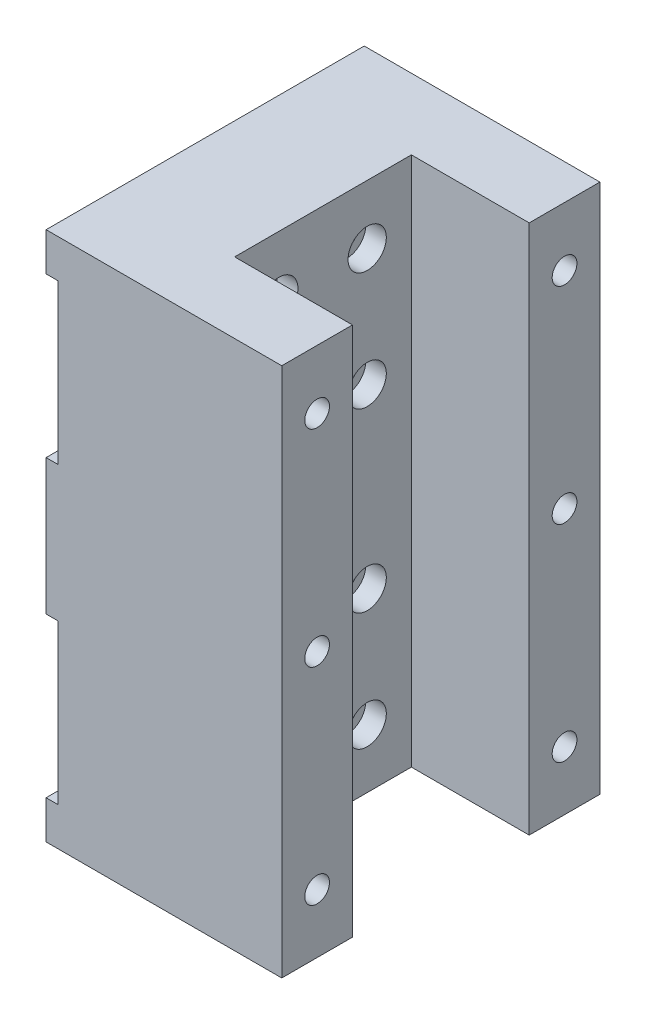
ISO-10303-21;
HEADER;
FILE_DESCRIPTION(('STEP AP214'),'2;1');
FILE_NAME('part.step','',(''),(''),'','','');
FILE_SCHEMA(('AUTOMOTIVE_DESIGN { 1 0 10303 214 1 1 1 1 }'));
ENDSEC;
DATA;
#1=APPLICATION_CONTEXT('core data for automotive mechanical design processes');
#2=APPLICATION_PROTOCOL_DEFINITION('international standard','automotive_design',2000,#1);
#3=PRODUCT_CONTEXT('',#1,'mechanical');
#4=PRODUCT('Part','Part','',(#3));
#5=PRODUCT_RELATED_PRODUCT_CATEGORY('part','',(#4));
#6=PRODUCT_DEFINITION_FORMATION('','',#4);
#7=PRODUCT_DEFINITION_CONTEXT('part definition',#1,'design');
#8=PRODUCT_DEFINITION('design','',#6,#7);
#9=PRODUCT_DEFINITION_SHAPE('','',#8);
#10=(LENGTH_UNIT() NAMED_UNIT(*) SI_UNIT(.MILLI.,.METRE.));
#11=(NAMED_UNIT(*) PLANE_ANGLE_UNIT() SI_UNIT($,.RADIAN.));
#12=(NAMED_UNIT(*) SI_UNIT($,.STERADIAN.) SOLID_ANGLE_UNIT());
#13=UNCERTAINTY_MEASURE_WITH_UNIT(LENGTH_MEASURE(1.E-05),#10,'distance_accuracy_value','');
#14=(GEOMETRIC_REPRESENTATION_CONTEXT(3) GLOBAL_UNCERTAINTY_ASSIGNED_CONTEXT((#13)) GLOBAL_UNIT_ASSIGNED_CONTEXT((#10,
#11,#12)) REPRESENTATION_CONTEXT('',''));
#15=CARTESIAN_POINT('',(0.,0.,0.));
#16=DIRECTION('',(0.,0.,1.));
#17=DIRECTION('',(1.,0.,0.));
#18=AXIS2_PLACEMENT_3D('',#15,#16,#17);
#19=CARTESIAN_POINT('',(-5.,80.,34.5));
#20=DIRECTION('',(1.,0.,0.));
#21=DIRECTION('',(0.,0.,-1.));
#22=AXIS2_PLACEMENT_3D('',#19,#20,#21);
#23=CYLINDRICAL_SURFACE('',#22,1.75);
#24=CARTESIAN_POINT('',(2.,80.,34.5));
#25=DIRECTION('',(1.,0.,0.));
#26=DIRECTION('',(0.,0.,-1.));
#27=AXIS2_PLACEMENT_3D('',#24,#25,#26);
#28=CIRCLE('',#27,1.75);
#29=CARTESIAN_POINT('',(2.,80.,32.75));
#30=VERTEX_POINT('',#29);
#31=EDGE_CURVE('E592',#30,#30,#28,.T.);
#32=ORIENTED_EDGE('',*,*,#31,.F.);
#33=EDGE_LOOP('',(#32));
#34=FACE_BOUND('',#33,.T.);
#35=CARTESIAN_POINT('',(16.5,80.,34.5));
#36=DIRECTION('',(1.,0.,0.));
#37=DIRECTION('',(0.,0.,-1.));
#38=AXIS2_PLACEMENT_3D('',#35,#36,#37);
#39=CIRCLE('',#38,1.75);
#40=CARTESIAN_POINT('',(16.5,80.,32.75));
#41=VERTEX_POINT('',#40);
#42=EDGE_CURVE('E36',#41,#41,#39,.F.);
#43=ORIENTED_EDGE('',*,*,#42,.F.);
#44=EDGE_LOOP('',(#43));
#45=FACE_BOUND('',#44,.T.);
#46=ADVANCED_FACE('F32',(#34,#45),#23,.F.);
#47=CARTESIAN_POINT('',(-5.,80.,19.5));
#48=DIRECTION('',(1.,0.,0.));
#49=DIRECTION('',(0.,0.,-1.));
#50=AXIS2_PLACEMENT_3D('',#47,#48,#49);
#51=CYLINDRICAL_SURFACE('',#50,1.75);
#52=CARTESIAN_POINT('',(2.,80.,19.5));
#53=DIRECTION('',(1.,0.,0.));
#54=DIRECTION('',(0.,0.,-1.));
#55=AXIS2_PLACEMENT_3D('',#52,#53,#54);
#56=CIRCLE('',#55,1.75);
#57=CARTESIAN_POINT('',(2.,80.,17.75));
#58=VERTEX_POINT('',#57);
#59=EDGE_CURVE('E589',#58,#58,#56,.T.);
#60=ORIENTED_EDGE('',*,*,#59,.F.);
#61=EDGE_LOOP('',(#60));
#62=FACE_BOUND('',#61,.T.);
#63=CARTESIAN_POINT('',(16.5,80.,19.5));
#64=DIRECTION('',(1.,0.,0.));
#65=DIRECTION('',(0.,0.,-1.));
#66=AXIS2_PLACEMENT_3D('',#63,#64,#65);
#67=CIRCLE('',#66,1.75);
#68=CARTESIAN_POINT('',(16.5,80.,17.75));
#69=VERTEX_POINT('',#68);
#70=EDGE_CURVE('E634',#69,#69,#67,.F.);
#71=ORIENTED_EDGE('',*,*,#70,.F.);
#72=EDGE_LOOP('',(#71));
#73=FACE_BOUND('',#72,.T.);
#74=ADVANCED_FACE('F309',(#62,#73),#51,.F.);
#75=CARTESIAN_POINT('',(-5.,60.,19.5));
#76=DIRECTION('',(1.,0.,0.));
#77=DIRECTION('',(0.,0.,-1.));
#78=AXIS2_PLACEMENT_3D('',#75,#76,#77);
#79=CYLINDRICAL_SURFACE('',#78,1.75);
#80=CARTESIAN_POINT('',(2.,60.,19.5));
#81=DIRECTION('',(1.,0.,0.));
#82=DIRECTION('',(0.,0.,-1.));
#83=AXIS2_PLACEMENT_3D('',#80,#81,#82);
#84=CIRCLE('',#83,1.75);
#85=CARTESIAN_POINT('',(2.,60.,17.75));
#86=VERTEX_POINT('',#85);
#87=EDGE_CURVE('E586',#86,#86,#84,.T.);
#88=ORIENTED_EDGE('',*,*,#87,.F.);
#89=EDGE_LOOP('',(#88));
#90=FACE_BOUND('',#89,.T.);
#91=CARTESIAN_POINT('',(16.5,60.,19.5));
#92=DIRECTION('',(1.,0.,0.));
#93=DIRECTION('',(0.,0.,-1.));
#94=AXIS2_PLACEMENT_3D('',#91,#92,#93);
#95=CIRCLE('',#94,1.75);
#96=CARTESIAN_POINT('',(16.5,60.,17.75));
#97=VERTEX_POINT('',#96);
#98=EDGE_CURVE('E627',#97,#97,#95,.F.);
#99=ORIENTED_EDGE('',*,*,#98,.F.);
#100=EDGE_LOOP('',(#99));
#101=FACE_BOUND('',#100,.T.);
#102=ADVANCED_FACE('F315',(#90,#101),#79,.F.);
#103=CARTESIAN_POINT('',(-5.,60.,34.5));
#104=DIRECTION('',(1.,0.,0.));
#105=DIRECTION('',(0.,0.,-1.));
#106=AXIS2_PLACEMENT_3D('',#103,#104,#105);
#107=CYLINDRICAL_SURFACE('',#106,1.75);
#108=CARTESIAN_POINT('',(2.,60.,34.5));
#109=DIRECTION('',(1.,0.,0.));
#110=DIRECTION('',(0.,0.,-1.));
#111=AXIS2_PLACEMENT_3D('',#108,#109,#110);
#112=CIRCLE('',#111,1.75);
#113=CARTESIAN_POINT('',(2.,60.,32.75));
#114=VERTEX_POINT('',#113);
#115=EDGE_CURVE('E583',#114,#114,#112,.T.);
#116=ORIENTED_EDGE('',*,*,#115,.F.);
#117=EDGE_LOOP('',(#116));
#118=FACE_BOUND('',#117,.T.);
#119=CARTESIAN_POINT('',(16.5,60.,34.5));
#120=DIRECTION('',(1.,0.,0.));
#121=DIRECTION('',(0.,0.,-1.));
#122=AXIS2_PLACEMENT_3D('',#119,#120,#121);
#123=CIRCLE('',#122,1.75);
#124=CARTESIAN_POINT('',(16.5,60.,32.75));
#125=VERTEX_POINT('',#124);
#126=EDGE_CURVE('E620',#125,#125,#123,.F.);
#127=ORIENTED_EDGE('',*,*,#126,.F.);
#128=EDGE_LOOP('',(#127));
#129=FACE_BOUND('',#128,.T.);
#130=ADVANCED_FACE('F326',(#118,#129),#107,.F.);
#131=CARTESIAN_POINT('',(-5.,10.,19.5));
#132=DIRECTION('',(1.,0.,0.));
#133=DIRECTION('',(0.,0.,-1.));
#134=AXIS2_PLACEMENT_3D('',#131,#132,#133);
#135=CYLINDRICAL_SURFACE('',#134,1.75);
#136=CARTESIAN_POINT('',(2.,10.,19.5));
#137=DIRECTION('',(1.,0.,0.));
#138=DIRECTION('',(0.,0.,-1.));
#139=AXIS2_PLACEMENT_3D('',#136,#137,#138);
#140=CIRCLE('',#139,1.75);
#141=CARTESIAN_POINT('',(2.,10.,17.75));
#142=VERTEX_POINT('',#141);
#143=EDGE_CURVE('E580',#142,#142,#140,.T.);
#144=ORIENTED_EDGE('',*,*,#143,.F.);
#145=EDGE_LOOP('',(#144));
#146=FACE_BOUND('',#145,.T.);
#147=CARTESIAN_POINT('',(16.5,10.,19.5));
#148=DIRECTION('',(1.,0.,0.));
#149=DIRECTION('',(0.,0.,-1.));
#150=AXIS2_PLACEMENT_3D('',#147,#148,#149);
#151=CIRCLE('',#150,1.75);
#152=CARTESIAN_POINT('',(16.5,10.,17.75));
#153=VERTEX_POINT('',#152);
#154=EDGE_CURVE('E613',#153,#153,#151,.F.);
#155=ORIENTED_EDGE('',*,*,#154,.F.);
#156=EDGE_LOOP('',(#155));
#157=FACE_BOUND('',#156,.T.);
#158=ADVANCED_FACE('F330',(#146,#157),#135,.F.);
#159=CARTESIAN_POINT('',(-5.,10.,34.5));
#160=DIRECTION('',(1.,0.,0.));
#161=DIRECTION('',(0.,0.,-1.));
#162=AXIS2_PLACEMENT_3D('',#159,#160,#161);
#163=CYLINDRICAL_SURFACE('',#162,1.75);
#164=CARTESIAN_POINT('',(2.,10.,34.5));
#165=DIRECTION('',(1.,0.,0.));
#166=DIRECTION('',(0.,0.,-1.));
#167=AXIS2_PLACEMENT_3D('',#164,#165,#166);
#168=CIRCLE('',#167,1.75);
#169=CARTESIAN_POINT('',(2.,10.,32.75));
#170=VERTEX_POINT('',#169);
#171=EDGE_CURVE('E577',#170,#170,#168,.T.);
#172=ORIENTED_EDGE('',*,*,#171,.F.);
#173=EDGE_LOOP('',(#172));
#174=FACE_BOUND('',#173,.T.);
#175=CARTESIAN_POINT('',(16.5,10.,34.5));
#176=DIRECTION('',(1.,0.,0.));
#177=DIRECTION('',(0.,0.,-1.));
#178=AXIS2_PLACEMENT_3D('',#175,#176,#177);
#179=CIRCLE('',#178,1.75);
#180=CARTESIAN_POINT('',(16.5,10.,32.75));
#181=VERTEX_POINT('',#180);
#182=EDGE_CURVE('E606',#181,#181,#179,.F.);
#183=ORIENTED_EDGE('',*,*,#182,.F.);
#184=EDGE_LOOP('',(#183));
#185=FACE_BOUND('',#184,.T.);
#186=ADVANCED_FACE('F334',(#174,#185),#163,.F.);
#187=CARTESIAN_POINT('',(-5.,30.,19.5));
#188=DIRECTION('',(1.,0.,0.));
#189=DIRECTION('',(0.,0.,-1.));
#190=AXIS2_PLACEMENT_3D('',#187,#188,#189);
#191=CYLINDRICAL_SURFACE('',#190,1.75);
#192=CARTESIAN_POINT('',(2.,30.,19.5));
#193=DIRECTION('',(1.,0.,0.));
#194=DIRECTION('',(0.,0.,-1.));
#195=AXIS2_PLACEMENT_3D('',#192,#193,#194);
#196=CIRCLE('',#195,1.75);
#197=CARTESIAN_POINT('',(2.,30.,17.75));
#198=VERTEX_POINT('',#197);
#199=EDGE_CURVE('E574',#198,#198,#196,.T.);
#200=ORIENTED_EDGE('',*,*,#199,.F.);
#201=EDGE_LOOP('',(#200));
#202=FACE_BOUND('',#201,.T.);
#203=CARTESIAN_POINT('',(16.5,30.,19.5));
#204=DIRECTION('',(1.,0.,0.));
#205=DIRECTION('',(0.,0.,-1.));
#206=AXIS2_PLACEMENT_3D('',#203,#204,#205);
#207=CIRCLE('',#206,1.75);
#208=CARTESIAN_POINT('',(16.5,30.,17.75));
#209=VERTEX_POINT('',#208);
#210=EDGE_CURVE('E599',#209,#209,#207,.F.);
#211=ORIENTED_EDGE('',*,*,#210,.F.);
#212=EDGE_LOOP('',(#211));
#213=FACE_BOUND('',#212,.T.);
#214=ADVANCED_FACE('F338',(#202,#213),#191,.F.);
#215=CARTESIAN_POINT('',(-5.,30.,34.5));
#216=DIRECTION('',(1.,0.,0.));
#217=DIRECTION('',(0.,0.,-1.));
#218=AXIS2_PLACEMENT_3D('',#215,#216,#217);
#219=CYLINDRICAL_SURFACE('',#218,1.75);
#220=CARTESIAN_POINT('',(2.,30.,34.5));
#221=DIRECTION('',(1.,0.,0.));
#222=DIRECTION('',(0.,0.,-1.));
#223=AXIS2_PLACEMENT_3D('',#220,#221,#222);
#224=CIRCLE('',#223,1.75);
#225=CARTESIAN_POINT('',(2.,30.,32.75));
#226=VERTEX_POINT('',#225);
#227=EDGE_CURVE('E569',#226,#226,#224,.T.);
#228=ORIENTED_EDGE('',*,*,#227,.F.);
#229=EDGE_LOOP('',(#228));
#230=FACE_BOUND('',#229,.T.);
#231=CARTESIAN_POINT('',(16.5,30.,34.5));
#232=DIRECTION('',(1.,0.,0.));
#233=DIRECTION('',(0.,0.,-1.));
#234=AXIS2_PLACEMENT_3D('',#231,#232,#233);
#235=CIRCLE('',#234,1.75);
#236=CARTESIAN_POINT('',(16.5,30.,32.75));
#237=VERTEX_POINT('',#236);
#238=EDGE_CURVE('E369',#237,#237,#235,.F.);
#239=ORIENTED_EDGE('',*,*,#238,.F.);
#240=EDGE_LOOP('',(#239));
#241=FACE_BOUND('',#240,.T.);
#242=ADVANCED_FACE('F342',(#230,#241),#219,.F.);
#243=CARTESIAN_POINT('',(40.,0.,54.));
#244=DIRECTION('',(-1.,0.,0.));
#245=DIRECTION('',(0.,0.,1.));
#246=AXIS2_PLACEMENT_3D('',#243,#244,#245);
#247=PLANE('',#246);
#248=CARTESIAN_POINT('',(40.,9.99999999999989,6.));
#249=DIRECTION('',(1.,0.,0.));
#250=DIRECTION('',(0.,0.,-1.));
#251=AXIS2_PLACEMENT_3D('',#248,#249,#250);
#252=CIRCLE('',#251,2.1);
#253=CARTESIAN_POINT('',(40.,9.99999999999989,3.9));
#254=VERTEX_POINT('',#253);
#255=EDGE_CURVE('E368',#254,#254,#252,.T.);
#256=ORIENTED_EDGE('',*,*,#255,.F.);
#257=EDGE_LOOP('',(#256));
#258=FACE_BOUND('',#257,.T.);
#259=CARTESIAN_POINT('',(40.,44.9999999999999,6.));
#260=DIRECTION('',(1.,0.,0.));
#261=DIRECTION('',(0.,0.,-1.));
#262=AXIS2_PLACEMENT_3D('',#259,#260,#261);
#263=CIRCLE('',#262,2.1);
#264=CARTESIAN_POINT('',(40.,44.9999999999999,3.9));
#265=VERTEX_POINT('',#264);
#266=EDGE_CURVE('E556',#265,#265,#263,.T.);
#267=ORIENTED_EDGE('',*,*,#266,.F.);
#268=EDGE_LOOP('',(#267));
#269=FACE_BOUND('',#268,.T.);
#270=CARTESIAN_POINT('',(40.,80.,6.));
#271=DIRECTION('',(1.,0.,0.));
#272=DIRECTION('',(0.,0.,-1.));
#273=AXIS2_PLACEMENT_3D('',#270,#271,#272);
#274=CIRCLE('',#273,2.1);
#275=CARTESIAN_POINT('',(40.,80.,3.9));
#276=VERTEX_POINT('',#275);
#277=EDGE_CURVE('E544',#276,#276,#274,.T.);
#278=ORIENTED_EDGE('',*,*,#277,.F.);
#279=EDGE_LOOP('',(#278));
#280=FACE_BOUND('',#279,.T.);
#281=DIRECTION('',(0.,0.,-1.));
#282=VECTOR('',#281,1.);
#283=CARTESIAN_POINT('',(40.,89.9999999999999,54.));
#284=LINE('',#283,#282);
#285=CARTESIAN_POINT('',(40.,89.9999999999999,12.));
#286=VERTEX_POINT('',#285);
#287=CARTESIAN_POINT('',(40.,89.9999999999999,0.));
#288=VERTEX_POINT('',#287);
#289=EDGE_CURVE('E201',#286,#288,#284,.T.);
#290=ORIENTED_EDGE('',*,*,#289,.F.);
#291=DIRECTION('',(0.,-1.,0.));
#292=VECTOR('',#291,1.);
#293=CARTESIAN_POINT('',(40.,0.,12.));
#294=LINE('',#293,#292);
#295=CARTESIAN_POINT('',(40.,0.,12.));
#296=VERTEX_POINT('',#295);
#297=EDGE_CURVE('E176',#286,#296,#294,.T.);
#298=ORIENTED_EDGE('',*,*,#297,.T.);
#299=DIRECTION('',(0.,0.,-1.));
#300=VECTOR('',#299,1.);
#301=CARTESIAN_POINT('',(40.,0.,54.));
#302=LINE('',#301,#300);
#303=CARTESIAN_POINT('',(40.,0.,0.));
#304=VERTEX_POINT('',#303);
#305=EDGE_CURVE('E162',#296,#304,#302,.T.);
#306=ORIENTED_EDGE('',*,*,#305,.T.);
#307=DIRECTION('',(0.,1.,0.));
#308=VECTOR('',#307,1.);
#309=CARTESIAN_POINT('',(40.,0.,0.));
#310=LINE('',#309,#308);
#311=EDGE_CURVE('E195',#304,#288,#310,.T.);
#312=ORIENTED_EDGE('',*,*,#311,.T.);
#313=EDGE_LOOP('',(#290,#298,#306,#312));
#314=FACE_BOUND('',#313,.T.);
#315=ADVANCED_FACE('F346',(#258,#269,#280,#314),#247,.F.);
#316=CARTESIAN_POINT('',(0.,83.4999999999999,54.));
#317=DIRECTION('',(1.,0.,0.));
#318=DIRECTION('',(0.,0.,-1.));
#319=AXIS2_PLACEMENT_3D('',#316,#317,#318);
#320=PLANE('',#319);
#321=DIRECTION('',(0.,-1.,0.));
#322=VECTOR('',#321,1.);
#323=CARTESIAN_POINT('',(0.,83.4999999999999,0.));
#324=LINE('',#323,#322);
#325=CARTESIAN_POINT('',(0.,89.9999999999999,0.));
#326=VERTEX_POINT('',#325);
#327=CARTESIAN_POINT('',(0.,83.4999999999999,0.));
#328=VERTEX_POINT('',#327);
#329=EDGE_CURVE('E172',#326,#328,#324,.T.);
#330=ORIENTED_EDGE('',*,*,#329,.T.);
#331=DIRECTION('',(0.,0.,-1.));
#332=VECTOR('',#331,1.);
#333=CARTESIAN_POINT('',(0.,83.4999999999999,54.));
#334=LINE('',#333,#332);
#335=CARTESIAN_POINT('',(0.,83.4999999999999,54.));
#336=VERTEX_POINT('',#335);
#337=EDGE_CURVE('E41',#336,#328,#334,.T.);
#338=ORIENTED_EDGE('',*,*,#337,.F.);
#339=DIRECTION('',(0.,-1.,0.));
#340=VECTOR('',#339,1.);
#341=CARTESIAN_POINT('',(0.,83.4999999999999,54.));
#342=LINE('',#341,#340);
#343=CARTESIAN_POINT('',(0.,89.9999999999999,54.));
#344=VERTEX_POINT('',#343);
#345=EDGE_CURVE('E199',#344,#336,#342,.T.);
#346=ORIENTED_EDGE('',*,*,#345,.F.);
#347=DIRECTION('',(0.,0.,-1.));
#348=VECTOR('',#347,1.);
#349=CARTESIAN_POINT('',(0.,89.9999999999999,54.));
#350=LINE('',#349,#348);
#351=EDGE_CURVE('E168',#344,#326,#350,.T.);
#352=ORIENTED_EDGE('',*,*,#351,.T.);
#353=EDGE_LOOP('',(#330,#338,#346,#352));
#354=FACE_BOUND('',#353,.T.);
#355=ADVANCED_FACE('F34',(#354),#320,.F.);
#356=CARTESIAN_POINT('',(0.,83.4999999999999,54.));
#357=DIRECTION('',(0.,1.,0.));
#358=DIRECTION('',(0.,0.,1.));
#359=AXIS2_PLACEMENT_3D('',#356,#357,#358);
#360=PLANE('',#359);
#361=DIRECTION('',(1.,0.,0.));
#362=VECTOR('',#361,1.);
#363=CARTESIAN_POINT('',(0.,83.4999999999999,0.));
#364=LINE('',#363,#362);
#365=CARTESIAN_POINT('',(2.,83.4999999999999,0.));
#366=VERTEX_POINT('',#365);
#367=EDGE_CURVE('E175',#328,#366,#364,.T.);
#368=ORIENTED_EDGE('',*,*,#367,.T.);
#369=DIRECTION('',(0.,0.,-1.));
#370=VECTOR('',#369,1.);
#371=CARTESIAN_POINT('',(2.,83.4999999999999,54.));
#372=LINE('',#371,#370);
#373=CARTESIAN_POINT('',(2.,83.4999999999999,54.));
#374=VERTEX_POINT('',#373);
#375=EDGE_CURVE('E222',#374,#366,#372,.T.);
#376=ORIENTED_EDGE('',*,*,#375,.F.);
#377=DIRECTION('',(1.,0.,0.));
#378=VECTOR('',#377,1.);
#379=CARTESIAN_POINT('',(0.,83.4999999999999,54.));
#380=LINE('',#379,#378);
#381=EDGE_CURVE('E111',#336,#374,#380,.T.);
#382=ORIENTED_EDGE('',*,*,#381,.F.);
#383=ORIENTED_EDGE('',*,*,#337,.T.);
#384=EDGE_LOOP('',(#368,#376,#382,#383));
#385=FACE_BOUND('',#384,.T.);
#386=ADVANCED_FACE('F430',(#385),#360,.F.);
#387=CARTESIAN_POINT('',(2.,56.4999999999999,54.));
#388=DIRECTION('',(1.,0.,0.));
#389=DIRECTION('',(0.,0.,-1.));
#390=AXIS2_PLACEMENT_3D('',#387,#388,#389);
#391=PLANE('',#390);
#392=ORIENTED_EDGE('',*,*,#31,.T.);
#393=EDGE_LOOP('',(#392));
#394=FACE_BOUND('',#393,.T.);
#395=ORIENTED_EDGE('',*,*,#59,.T.);
#396=EDGE_LOOP('',(#395));
#397=FACE_BOUND('',#396,.T.);
#398=ORIENTED_EDGE('',*,*,#87,.T.);
#399=EDGE_LOOP('',(#398));
#400=FACE_BOUND('',#399,.T.);
#401=ORIENTED_EDGE('',*,*,#115,.T.);
#402=EDGE_LOOP('',(#401));
#403=FACE_BOUND('',#402,.T.);
#404=DIRECTION('',(0.,-1.,0.));
#405=VECTOR('',#404,1.);
#406=CARTESIAN_POINT('',(2.,56.4999999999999,0.));
#407=LINE('',#406,#405);
#408=CARTESIAN_POINT('',(2.,56.4999999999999,0.));
#409=VERTEX_POINT('',#408);
#410=EDGE_CURVE('E178',#366,#409,#407,.T.);
#411=ORIENTED_EDGE('',*,*,#410,.T.);
#412=DIRECTION('',(0.,0.,-1.));
#413=VECTOR('',#412,1.);
#414=CARTESIAN_POINT('',(2.,56.4999999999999,54.));
#415=LINE('',#414,#413);
#416=CARTESIAN_POINT('',(2.,56.4999999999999,54.));
#417=VERTEX_POINT('',#416);
#418=EDGE_CURVE('E219',#417,#409,#415,.T.);
#419=ORIENTED_EDGE('',*,*,#418,.F.);
#420=DIRECTION('',(0.,-1.,0.));
#421=VECTOR('',#420,1.);
#422=CARTESIAN_POINT('',(2.,56.4999999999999,54.));
#423=LINE('',#422,#421);
#424=EDGE_CURVE('E443',#374,#417,#423,.T.);
#425=ORIENTED_EDGE('',*,*,#424,.F.);
#426=ORIENTED_EDGE('',*,*,#375,.T.);
#427=EDGE_LOOP('',(#411,#419,#425,#426));
#428=FACE_BOUND('',#427,.T.);
#429=ADVANCED_FACE('F427',(#394,#397,#400,#403,#428),#391,.F.);
#430=CARTESIAN_POINT('',(0.,56.4999999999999,54.));
#431=DIRECTION('',(0.,-1.,0.));
#432=DIRECTION('',(0.,0.,-1.));
#433=AXIS2_PLACEMENT_3D('',#430,#431,#432);
#434=PLANE('',#433);
#435=DIRECTION('',(-1.,0.,0.));
#436=VECTOR('',#435,1.);
#437=CARTESIAN_POINT('',(0.,56.4999999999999,0.));
#438=LINE('',#437,#436);
#439=CARTESIAN_POINT('',(0.,56.4999999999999,0.));
#440=VERTEX_POINT('',#439);
#441=EDGE_CURVE('E180',#409,#440,#438,.T.);
#442=ORIENTED_EDGE('',*,*,#441,.T.);
#443=DIRECTION('',(0.,0.,-1.));
#444=VECTOR('',#443,1.);
#445=CARTESIAN_POINT('',(0.,56.4999999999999,54.));
#446=LINE('',#445,#444);
#447=CARTESIAN_POINT('',(0.,56.4999999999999,54.));
#448=VERTEX_POINT('',#447);
#449=EDGE_CURVE('E216',#448,#440,#446,.T.);
#450=ORIENTED_EDGE('',*,*,#449,.F.);
#451=DIRECTION('',(-1.,0.,0.));
#452=VECTOR('',#451,1.);
#453=CARTESIAN_POINT('',(0.,56.4999999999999,54.));
#454=LINE('',#453,#452);
#455=EDGE_CURVE('E454',#417,#448,#454,.T.);
#456=ORIENTED_EDGE('',*,*,#455,.F.);
#457=ORIENTED_EDGE('',*,*,#418,.T.);
#458=EDGE_LOOP('',(#442,#450,#456,#457));
#459=FACE_BOUND('',#458,.T.);
#460=ADVANCED_FACE('F423',(#459),#434,.F.);
#461=CARTESIAN_POINT('',(0.,33.4999999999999,54.));
#462=DIRECTION('',(1.,0.,0.));
#463=DIRECTION('',(0.,0.,-1.));
#464=AXIS2_PLACEMENT_3D('',#461,#462,#463);
#465=PLANE('',#464);
#466=DIRECTION('',(0.,-1.,0.));
#467=VECTOR('',#466,1.);
#468=CARTESIAN_POINT('',(0.,33.4999999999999,0.));
#469=LINE('',#468,#467);
#470=CARTESIAN_POINT('',(0.,33.4999999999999,0.));
#471=VERTEX_POINT('',#470);
#472=EDGE_CURVE('E182',#440,#471,#469,.T.);
#473=ORIENTED_EDGE('',*,*,#472,.T.);
#474=DIRECTION('',(0.,0.,-1.));
#475=VECTOR('',#474,1.);
#476=CARTESIAN_POINT('',(0.,33.4999999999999,54.));
#477=LINE('',#476,#475);
#478=CARTESIAN_POINT('',(0.,33.4999999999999,54.));
#479=VERTEX_POINT('',#478);
#480=EDGE_CURVE('E213',#479,#471,#477,.T.);
#481=ORIENTED_EDGE('',*,*,#480,.F.);
#482=DIRECTION('',(0.,-1.,0.));
#483=VECTOR('',#482,1.);
#484=CARTESIAN_POINT('',(0.,33.4999999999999,54.));
#485=LINE('',#484,#483);
#486=EDGE_CURVE('E451',#448,#479,#485,.T.);
#487=ORIENTED_EDGE('',*,*,#486,.F.);
#488=ORIENTED_EDGE('',*,*,#449,.T.);
#489=EDGE_LOOP('',(#473,#481,#487,#488));
#490=FACE_BOUND('',#489,.T.);
#491=ADVANCED_FACE('F419',(#490),#465,.F.);
#492=CARTESIAN_POINT('',(2.,33.4999999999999,54.));
#493=DIRECTION('',(0.,1.,0.));
#494=DIRECTION('',(0.,0.,1.));
#495=AXIS2_PLACEMENT_3D('',#492,#493,#494);
#496=PLANE('',#495);
#497=DIRECTION('',(1.,0.,0.));
#498=VECTOR('',#497,1.);
#499=CARTESIAN_POINT('',(2.,33.4999999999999,0.));
#500=LINE('',#499,#498);
#501=CARTESIAN_POINT('',(2.,33.4999999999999,0.));
#502=VERTEX_POINT('',#501);
#503=EDGE_CURVE('E184',#471,#502,#500,.T.);
#504=ORIENTED_EDGE('',*,*,#503,.T.);
#505=DIRECTION('',(0.,0.,-1.));
#506=VECTOR('',#505,1.);
#507=CARTESIAN_POINT('',(2.,33.4999999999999,54.));
#508=LINE('',#507,#506);
#509=CARTESIAN_POINT('',(2.,33.4999999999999,54.));
#510=VERTEX_POINT('',#509);
#511=EDGE_CURVE('E210',#510,#502,#508,.T.);
#512=ORIENTED_EDGE('',*,*,#511,.F.);
#513=DIRECTION('',(1.,0.,0.));
#514=VECTOR('',#513,1.);
#515=CARTESIAN_POINT('',(2.,33.4999999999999,54.));
#516=LINE('',#515,#514);
#517=EDGE_CURVE('E453',#479,#510,#516,.T.);
#518=ORIENTED_EDGE('',*,*,#517,.F.);
#519=ORIENTED_EDGE('',*,*,#480,.T.);
#520=EDGE_LOOP('',(#504,#512,#518,#519));
#521=FACE_BOUND('',#520,.T.);
#522=ADVANCED_FACE('F415',(#521),#496,.F.);
#523=CARTESIAN_POINT('',(2.,6.49999999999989,54.));
#524=DIRECTION('',(1.,0.,0.));
#525=DIRECTION('',(0.,0.,-1.));
#526=AXIS2_PLACEMENT_3D('',#523,#524,#525);
#527=PLANE('',#526);
#528=ORIENTED_EDGE('',*,*,#143,.T.);
#529=EDGE_LOOP('',(#528));
#530=FACE_BOUND('',#529,.T.);
#531=ORIENTED_EDGE('',*,*,#171,.T.);
#532=EDGE_LOOP('',(#531));
#533=FACE_BOUND('',#532,.T.);
#534=ORIENTED_EDGE('',*,*,#199,.T.);
#535=EDGE_LOOP('',(#534));
#536=FACE_BOUND('',#535,.T.);
#537=ORIENTED_EDGE('',*,*,#227,.T.);
#538=EDGE_LOOP('',(#537));
#539=FACE_BOUND('',#538,.T.);
#540=DIRECTION('',(0.,-1.,0.));
#541=VECTOR('',#540,1.);
#542=CARTESIAN_POINT('',(2.,6.49999999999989,0.));
#543=LINE('',#542,#541);
#544=CARTESIAN_POINT('',(2.,6.49999999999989,0.));
#545=VERTEX_POINT('',#544);
#546=EDGE_CURVE('E186',#502,#545,#543,.T.);
#547=ORIENTED_EDGE('',*,*,#546,.T.);
#548=DIRECTION('',(0.,0.,-1.));
#549=VECTOR('',#548,1.);
#550=CARTESIAN_POINT('',(2.,6.49999999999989,54.));
#551=LINE('',#550,#549);
#552=CARTESIAN_POINT('',(2.,6.49999999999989,54.));
#553=VERTEX_POINT('',#552);
#554=EDGE_CURVE('E207',#553,#545,#551,.T.);
#555=ORIENTED_EDGE('',*,*,#554,.F.);
#556=DIRECTION('',(0.,-1.,0.));
#557=VECTOR('',#556,1.);
#558=CARTESIAN_POINT('',(2.,6.49999999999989,54.));
#559=LINE('',#558,#557);
#560=EDGE_CURVE('E456',#510,#553,#559,.T.);
#561=ORIENTED_EDGE('',*,*,#560,.F.);
#562=ORIENTED_EDGE('',*,*,#511,.T.);
#563=EDGE_LOOP('',(#547,#555,#561,#562));
#564=FACE_BOUND('',#563,.T.);
#565=ADVANCED_FACE('F411',(#530,#533,#536,#539,#564),#527,.F.);
#566=CARTESIAN_POINT('',(2.,6.49999999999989,54.));
#567=DIRECTION('',(0.,-1.,0.));
#568=DIRECTION('',(0.,0.,-1.));
#569=AXIS2_PLACEMENT_3D('',#566,#567,#568);
#570=PLANE('',#569);
#571=DIRECTION('',(-1.,0.,0.));
#572=VECTOR('',#571,1.);
#573=CARTESIAN_POINT('',(2.,6.49999999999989,0.));
#574=LINE('',#573,#572);
#575=CARTESIAN_POINT('',(0.,6.49999999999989,0.));
#576=VERTEX_POINT('',#575);
#577=EDGE_CURVE('E188',#545,#576,#574,.T.);
#578=ORIENTED_EDGE('',*,*,#577,.T.);
#579=DIRECTION('',(0.,0.,-1.));
#580=VECTOR('',#579,1.);
#581=CARTESIAN_POINT('',(0.,6.49999999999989,54.));
#582=LINE('',#581,#580);
#583=CARTESIAN_POINT('',(0.,6.49999999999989,54.));
#584=VERTEX_POINT('',#583);
#585=EDGE_CURVE('E204',#584,#576,#582,.T.);
#586=ORIENTED_EDGE('',*,*,#585,.F.);
#587=DIRECTION('',(-1.,0.,0.));
#588=VECTOR('',#587,1.);
#589=CARTESIAN_POINT('',(2.,6.49999999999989,54.));
#590=LINE('',#589,#588);
#591=EDGE_CURVE('E462',#553,#584,#590,.T.);
#592=ORIENTED_EDGE('',*,*,#591,.F.);
#593=ORIENTED_EDGE('',*,*,#554,.T.);
#594=EDGE_LOOP('',(#578,#586,#592,#593));
#595=FACE_BOUND('',#594,.T.);
#596=ADVANCED_FACE('F407',(#595),#570,.F.);
#597=CARTESIAN_POINT('',(0.,0.,54.));
#598=DIRECTION('',(1.,0.,0.));
#599=DIRECTION('',(0.,0.,-1.));
#600=AXIS2_PLACEMENT_3D('',#597,#598,#599);
#601=PLANE('',#600);
#602=DIRECTION('',(0.,-1.,0.));
#603=VECTOR('',#602,1.);
#604=CARTESIAN_POINT('',(0.,0.,0.));
#605=LINE('',#604,#603);
#606=CARTESIAN_POINT('',(0.,0.,0.));
#607=VERTEX_POINT('',#606);
#608=EDGE_CURVE('E190',#576,#607,#605,.T.);
#609=ORIENTED_EDGE('',*,*,#608,.T.);
#610=DIRECTION('',(0.,0.,-1.));
#611=VECTOR('',#610,1.);
#612=CARTESIAN_POINT('',(0.,0.,54.));
#613=LINE('',#612,#611);
#614=CARTESIAN_POINT('',(0.,0.,54.));
#615=VERTEX_POINT('',#614);
#616=EDGE_CURVE('E161',#615,#607,#613,.T.);
#617=ORIENTED_EDGE('',*,*,#616,.F.);
#618=DIRECTION('',(0.,-1.,0.));
#619=VECTOR('',#618,1.);
#620=CARTESIAN_POINT('',(0.,0.,54.));
#621=LINE('',#620,#619);
#622=EDGE_CURVE('E145',#584,#615,#621,.T.);
#623=ORIENTED_EDGE('',*,*,#622,.F.);
#624=ORIENTED_EDGE('',*,*,#585,.T.);
#625=EDGE_LOOP('',(#609,#617,#623,#624));
#626=FACE_BOUND('',#625,.T.);
#627=ADVANCED_FACE('F403',(#626),#601,.F.);
#628=CARTESIAN_POINT('',(0.,0.,54.));
#629=DIRECTION('',(0.,1.,0.));
#630=DIRECTION('',(0.,0.,1.));
#631=AXIS2_PLACEMENT_3D('',#628,#629,#630);
#632=PLANE('',#631);
#633=CARTESIAN_POINT('',(10.,0.,6.));
#634=DIRECTION('',(0.,-1.,0.));
#635=DIRECTION('',(0.,0.,-1.));
#636=AXIS2_PLACEMENT_3D('',#633,#634,#635);
#637=CIRCLE('',#636,2.5);
#638=CARTESIAN_POINT('',(10.,0.,3.5));
#639=VERTEX_POINT('',#638);
#640=EDGE_CURVE('E532',#639,#639,#637,.T.);
#641=ORIENTED_EDGE('',*,*,#640,.F.);
#642=EDGE_LOOP('',(#641));
#643=FACE_BOUND('',#642,.T.);
#644=CARTESIAN_POINT('',(10.,0.,48.));
#645=DIRECTION('',(0.,-1.,0.));
#646=DIRECTION('',(0.,0.,-1.));
#647=AXIS2_PLACEMENT_3D('',#644,#645,#646);
#648=CIRCLE('',#647,2.5);
#649=CARTESIAN_POINT('',(10.,0.,45.5));
#650=VERTEX_POINT('',#649);
#651=EDGE_CURVE('E526',#650,#650,#648,.T.);
#652=ORIENTED_EDGE('',*,*,#651,.F.);
#653=EDGE_LOOP('',(#652));
#654=FACE_BOUND('',#653,.T.);
#655=CARTESIAN_POINT('',(25.,0.,6.));
#656=DIRECTION('',(0.,-1.,0.));
#657=DIRECTION('',(0.,0.,-1.));
#658=AXIS2_PLACEMENT_3D('',#655,#656,#657);
#659=CIRCLE('',#658,2.5);
#660=CARTESIAN_POINT('',(25.,0.,3.5));
#661=VERTEX_POINT('',#660);
#662=EDGE_CURVE('E521',#661,#661,#659,.T.);
#663=ORIENTED_EDGE('',*,*,#662,.F.);
#664=EDGE_LOOP('',(#663));
#665=FACE_BOUND('',#664,.T.);
#666=CARTESIAN_POINT('',(25.,0.,48.));
#667=DIRECTION('',(0.,-1.,0.));
#668=DIRECTION('',(0.,0.,-1.));
#669=AXIS2_PLACEMENT_3D('',#666,#667,#668);
#670=CIRCLE('',#669,2.5);
#671=CARTESIAN_POINT('',(25.,0.,45.5));
#672=VERTEX_POINT('',#671);
#673=EDGE_CURVE('E504',#672,#672,#670,.T.);
#674=ORIENTED_EDGE('',*,*,#673,.F.);
#675=EDGE_LOOP('',(#674));
#676=FACE_BOUND('',#675,.T.);
#677=ORIENTED_EDGE('',*,*,#305,.F.);
#678=DIRECTION('',(-1.,0.,0.));
#679=VECTOR('',#678,1.);
#680=CARTESIAN_POINT('',(20.,0.,12.));
#681=LINE('',#680,#679);
#682=CARTESIAN_POINT('',(20.,0.,12.));
#683=VERTEX_POINT('',#682);
#684=EDGE_CURVE('E479',#296,#683,#681,.T.);
#685=ORIENTED_EDGE('',*,*,#684,.T.);
#686=DIRECTION('',(0.,0.,1.));
#687=VECTOR('',#686,1.);
#688=CARTESIAN_POINT('',(20.,0.,42.));
#689=LINE('',#688,#687);
#690=CARTESIAN_POINT('',(20.,0.,42.));
#691=VERTEX_POINT('',#690);
#692=EDGE_CURVE('E494',#683,#691,#689,.T.);
#693=ORIENTED_EDGE('',*,*,#692,.T.);
#694=DIRECTION('',(1.,0.,0.));
#695=VECTOR('',#694,1.);
#696=CARTESIAN_POINT('',(46.2369437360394,0.,42.));
#697=LINE('',#696,#695);
#698=CARTESIAN_POINT('',(40.,0.,42.));
#699=VERTEX_POINT('',#698);
#700=EDGE_CURVE('E158',#691,#699,#697,.T.);
#701=ORIENTED_EDGE('',*,*,#700,.T.);
#702=CARTESIAN_POINT('',(40.,0.,54.));
#703=VERTEX_POINT('',#702);
#704=EDGE_CURVE('E152',#703,#699,#302,.T.);
#705=ORIENTED_EDGE('',*,*,#704,.F.);
#706=DIRECTION('',(1.,0.,0.));
#707=VECTOR('',#706,1.);
#708=CARTESIAN_POINT('',(0.,0.,54.));
#709=LINE('',#708,#707);
#710=EDGE_CURVE('E138',#615,#703,#709,.T.);
#711=ORIENTED_EDGE('',*,*,#710,.F.);
#712=ORIENTED_EDGE('',*,*,#616,.T.);
#713=DIRECTION('',(1.,0.,0.));
#714=VECTOR('',#713,1.);
#715=CARTESIAN_POINT('',(0.,0.,0.));
#716=LINE('',#715,#714);
#717=EDGE_CURVE('E192',#607,#304,#716,.T.);
#718=ORIENTED_EDGE('',*,*,#717,.T.);
#719=EDGE_LOOP('',(#677,#685,#693,#701,#705,#711,#712,#718));
#720=FACE_BOUND('',#719,.T.);
#721=ADVANCED_FACE('F154',(#643,#654,#665,#676,#720),#632,.F.);
#722=CARTESIAN_POINT('',(40.,9.99999999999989,48.));
#723=DIRECTION('',(1.,0.,0.));
#724=DIRECTION('',(0.,0.,-1.));
#725=AXIS2_PLACEMENT_3D('',#722,#723,#724);
#726=CIRCLE('',#725,2.1);
#727=CARTESIAN_POINT('',(40.,9.99999999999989,45.9));
#728=VERTEX_POINT('',#727);
#729=EDGE_CURVE('E565',#728,#728,#726,.T.);
#730=ORIENTED_EDGE('',*,*,#729,.F.);
#731=EDGE_LOOP('',(#730));
#732=FACE_BOUND('',#731,.T.);
#733=CARTESIAN_POINT('',(40.,45.,48.));
#734=DIRECTION('',(1.,0.,0.));
#735=DIRECTION('',(0.,0.,-1.));
#736=AXIS2_PLACEMENT_3D('',#733,#734,#735);
#737=CIRCLE('',#736,2.1);
#738=CARTESIAN_POINT('',(40.,45.,45.9));
#739=VERTEX_POINT('',#738);
#740=EDGE_CURVE('E550',#739,#739,#737,.T.);
#741=ORIENTED_EDGE('',*,*,#740,.F.);
#742=EDGE_LOOP('',(#741));
#743=FACE_BOUND('',#742,.T.);
#744=CARTESIAN_POINT('',(40.,80.,48.));
#745=DIRECTION('',(1.,0.,0.));
#746=DIRECTION('',(0.,0.,-1.));
#747=AXIS2_PLACEMENT_3D('',#744,#745,#746);
#748=CIRCLE('',#747,2.1);
#749=CARTESIAN_POINT('',(40.,80.,45.9));
#750=VERTEX_POINT('',#749);
#751=EDGE_CURVE('E538',#750,#750,#748,.T.);
#752=ORIENTED_EDGE('',*,*,#751,.F.);
#753=EDGE_LOOP('',(#752));
#754=FACE_BOUND('',#753,.T.);
#755=ORIENTED_EDGE('',*,*,#704,.T.);
#756=DIRECTION('',(0.,1.,0.));
#757=VECTOR('',#756,1.);
#758=CARTESIAN_POINT('',(40.,0.,42.));
#759=LINE('',#758,#757);
#760=CARTESIAN_POINT('',(40.,89.9999999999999,42.));
#761=VERTEX_POINT('',#760);
#762=EDGE_CURVE('E498',#699,#761,#759,.T.);
#763=ORIENTED_EDGE('',*,*,#762,.T.);
#764=CARTESIAN_POINT('',(40.,89.9999999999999,54.));
#765=VERTEX_POINT('',#764);
#766=EDGE_CURVE('E166',#765,#761,#284,.T.);
#767=ORIENTED_EDGE('',*,*,#766,.F.);
#768=DIRECTION('',(0.,1.,0.));
#769=VECTOR('',#768,1.);
#770=CARTESIAN_POINT('',(40.,0.,54.));
#771=LINE('',#770,#769);
#772=EDGE_CURVE('E142',#703,#765,#771,.T.);
#773=ORIENTED_EDGE('',*,*,#772,.F.);
#774=EDGE_LOOP('',(#755,#763,#767,#773));
#775=FACE_BOUND('',#774,.T.);
#776=ADVANCED_FACE('F164',(#732,#743,#754,#775),#247,.F.);
#777=CARTESIAN_POINT('',(0.,89.9999999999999,54.));
#778=DIRECTION('',(0.,-1.,0.));
#779=DIRECTION('',(0.,0.,-1.));
#780=AXIS2_PLACEMENT_3D('',#777,#778,#779);
#781=PLANE('',#780);
#782=DIRECTION('',(0.,0.,1.));
#783=VECTOR('',#782,1.);
#784=CARTESIAN_POINT('',(20.,89.9999999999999,42.));
#785=LINE('',#784,#783);
#786=CARTESIAN_POINT('',(20.,89.9999999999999,12.));
#787=VERTEX_POINT('',#786);
#788=CARTESIAN_POINT('',(20.,89.9999999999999,42.));
#789=VERTEX_POINT('',#788);
#790=EDGE_CURVE('E49',#787,#789,#785,.T.);
#791=ORIENTED_EDGE('',*,*,#790,.F.);
#792=DIRECTION('',(1.,0.,0.));
#793=VECTOR('',#792,1.);
#794=CARTESIAN_POINT('',(0.,89.9999999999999,12.));
#795=LINE('',#794,#793);
#796=EDGE_CURVE('E11',#787,#286,#795,.T.);
#797=ORIENTED_EDGE('',*,*,#796,.T.);
#798=ORIENTED_EDGE('',*,*,#289,.T.);
#799=DIRECTION('',(-1.,0.,0.));
#800=VECTOR('',#799,1.);
#801=CARTESIAN_POINT('',(0.,89.9999999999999,0.));
#802=LINE('',#801,#800);
#803=EDGE_CURVE('E102',#288,#326,#802,.T.);
#804=ORIENTED_EDGE('',*,*,#803,.T.);
#805=ORIENTED_EDGE('',*,*,#351,.F.);
#806=DIRECTION('',(-1.,0.,0.));
#807=VECTOR('',#806,1.);
#808=CARTESIAN_POINT('',(0.,89.9999999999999,54.));
#809=LINE('',#808,#807);
#810=EDGE_CURVE('E58',#765,#344,#809,.T.);
#811=ORIENTED_EDGE('',*,*,#810,.F.);
#812=ORIENTED_EDGE('',*,*,#766,.T.);
#813=DIRECTION('',(1.,0.,0.));
#814=VECTOR('',#813,1.);
#815=CARTESIAN_POINT('',(46.2369437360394,89.9999999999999,42.));
#816=LINE('',#815,#814);
#817=EDGE_CURVE('E500',#789,#761,#816,.T.);
#818=ORIENTED_EDGE('',*,*,#817,.F.);
#819=EDGE_LOOP('',(#791,#797,#798,#804,#805,#811,#812,#818));
#820=FACE_BOUND('',#819,.T.);
#821=ADVANCED_FACE('F392',(#820),#781,.F.);
#822=CARTESIAN_POINT('',(0.,89.9999999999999,54.));
#823=DIRECTION('',(0.,0.,-1.));
#824=DIRECTION('',(-1.,0.,0.));
#825=AXIS2_PLACEMENT_3D('',#822,#823,#824);
#826=PLANE('',#825);
#827=ORIENTED_EDGE('',*,*,#345,.T.);
#828=ORIENTED_EDGE('',*,*,#381,.T.);
#829=ORIENTED_EDGE('',*,*,#424,.T.);
#830=ORIENTED_EDGE('',*,*,#455,.T.);
#831=ORIENTED_EDGE('',*,*,#486,.T.);
#832=ORIENTED_EDGE('',*,*,#517,.T.);
#833=ORIENTED_EDGE('',*,*,#560,.T.);
#834=ORIENTED_EDGE('',*,*,#591,.T.);
#835=ORIENTED_EDGE('',*,*,#622,.T.);
#836=ORIENTED_EDGE('',*,*,#710,.T.);
#837=ORIENTED_EDGE('',*,*,#772,.T.);
#838=ORIENTED_EDGE('',*,*,#810,.T.);
#839=EDGE_LOOP('',(#827,#828,#829,#830,#831,#832,#833,#834,#835,#836,#837,#838));
#840=FACE_BOUND('',#839,.T.);
#841=ADVANCED_FACE('F140',(#840),#826,.F.);
#842=CARTESIAN_POINT('',(0.,89.9999999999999,0.));
#843=DIRECTION('',(0.,0.,-1.));
#844=DIRECTION('',(-1.,0.,0.));
#845=AXIS2_PLACEMENT_3D('',#842,#843,#844);
#846=PLANE('',#845);
#847=ORIENTED_EDGE('',*,*,#329,.F.);
#848=ORIENTED_EDGE('',*,*,#803,.F.);
#849=ORIENTED_EDGE('',*,*,#311,.F.);
#850=ORIENTED_EDGE('',*,*,#717,.F.);
#851=ORIENTED_EDGE('',*,*,#608,.F.);
#852=ORIENTED_EDGE('',*,*,#577,.F.);
#853=ORIENTED_EDGE('',*,*,#546,.F.);
#854=ORIENTED_EDGE('',*,*,#503,.F.);
#855=ORIENTED_EDGE('',*,*,#472,.F.);
#856=ORIENTED_EDGE('',*,*,#441,.F.);
#857=ORIENTED_EDGE('',*,*,#410,.F.);
#858=ORIENTED_EDGE('',*,*,#367,.F.);
#859=EDGE_LOOP('',(#847,#848,#849,#850,#851,#852,#853,#854,#855,#856,#857,#858));
#860=FACE_BOUND('',#859,.T.);
#861=ADVANCED_FACE('F382',(#860),#846,.T.);
#862=CARTESIAN_POINT('',(20.,0.,12.));
#863=DIRECTION('',(0.,0.,-1.));
#864=DIRECTION('',(-1.,0.,0.));
#865=AXIS2_PLACEMENT_3D('',#862,#863,#864);
#866=PLANE('',#865);
#867=ORIENTED_EDGE('',*,*,#796,.F.);
#868=DIRECTION('',(0.,1.,0.));
#869=VECTOR('',#868,1.);
#870=CARTESIAN_POINT('',(20.,0.,12.));
#871=LINE('',#870,#869);
#872=EDGE_CURVE('E496',#683,#787,#871,.T.);
#873=ORIENTED_EDGE('',*,*,#872,.F.);
#874=ORIENTED_EDGE('',*,*,#684,.F.);
#875=ORIENTED_EDGE('',*,*,#297,.F.);
#876=EDGE_LOOP('',(#867,#873,#874,#875));
#877=FACE_BOUND('',#876,.T.);
#878=ADVANCED_FACE('F377',(#877),#866,.F.);
#879=CARTESIAN_POINT('',(46.2369437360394,0.,42.));
#880=DIRECTION('',(0.,0.,1.));
#881=DIRECTION('',(1.,0.,0.));
#882=AXIS2_PLACEMENT_3D('',#879,#880,#881);
#883=PLANE('',#882);
#884=ORIENTED_EDGE('',*,*,#700,.F.);
#885=DIRECTION('',(0.,1.,0.));
#886=VECTOR('',#885,1.);
#887=CARTESIAN_POINT('',(20.,0.,42.));
#888=LINE('',#887,#886);
#889=EDGE_CURVE('E493',#691,#789,#888,.T.);
#890=ORIENTED_EDGE('',*,*,#889,.T.);
#891=ORIENTED_EDGE('',*,*,#817,.T.);
#892=ORIENTED_EDGE('',*,*,#762,.F.);
#893=EDGE_LOOP('',(#884,#890,#891,#892));
#894=FACE_BOUND('',#893,.T.);
#895=ADVANCED_FACE('F381',(#894),#883,.F.);
#896=CARTESIAN_POINT('',(20.,0.,42.));
#897=DIRECTION('',(-1.,0.,0.));
#898=DIRECTION('',(0.,0.,1.));
#899=AXIS2_PLACEMENT_3D('',#896,#897,#898);
#900=PLANE('',#899);
#901=CARTESIAN_POINT('',(20.,80.,34.5));
#902=DIRECTION('',(1.,0.,0.));
#903=DIRECTION('',(0.,0.,-1.));
#904=AXIS2_PLACEMENT_3D('',#901,#902,#903);
#905=CIRCLE('',#904,3.25);
#906=CARTESIAN_POINT('',(20.,80.,31.25));
#907=VERTEX_POINT('',#906);
#908=EDGE_CURVE('E643',#907,#907,#905,.T.);
#909=ORIENTED_EDGE('',*,*,#908,.F.);
#910=EDGE_LOOP('',(#909));
#911=FACE_BOUND('',#910,.T.);
#912=CARTESIAN_POINT('',(20.,80.,19.5));
#913=DIRECTION('',(1.,0.,0.));
#914=DIRECTION('',(0.,0.,-1.));
#915=AXIS2_PLACEMENT_3D('',#912,#913,#914);
#916=CIRCLE('',#915,3.25);
#917=CARTESIAN_POINT('',(20.,80.,16.25));
#918=VERTEX_POINT('',#917);
#919=EDGE_CURVE('E637',#918,#918,#916,.T.);
#920=ORIENTED_EDGE('',*,*,#919,.F.);
#921=EDGE_LOOP('',(#920));
#922=FACE_BOUND('',#921,.T.);
#923=CARTESIAN_POINT('',(20.,60.,19.5));
#924=DIRECTION('',(1.,0.,0.));
#925=DIRECTION('',(0.,0.,-1.));
#926=AXIS2_PLACEMENT_3D('',#923,#924,#925);
#927=CIRCLE('',#926,3.25);
#928=CARTESIAN_POINT('',(20.,60.,16.25));
#929=VERTEX_POINT('',#928);
#930=EDGE_CURVE('E630',#929,#929,#927,.T.);
#931=ORIENTED_EDGE('',*,*,#930,.F.);
#932=EDGE_LOOP('',(#931));
#933=FACE_BOUND('',#932,.T.);
#934=CARTESIAN_POINT('',(20.,60.,34.5));
#935=DIRECTION('',(1.,0.,0.));
#936=DIRECTION('',(0.,0.,-1.));
#937=AXIS2_PLACEMENT_3D('',#934,#935,#936);
#938=CIRCLE('',#937,3.25);
#939=CARTESIAN_POINT('',(20.,60.,31.25));
#940=VERTEX_POINT('',#939);
#941=EDGE_CURVE('E623',#940,#940,#938,.T.);
#942=ORIENTED_EDGE('',*,*,#941,.F.);
#943=EDGE_LOOP('',(#942));
#944=FACE_BOUND('',#943,.T.);
#945=CARTESIAN_POINT('',(20.,10.,19.5));
#946=DIRECTION('',(1.,0.,0.));
#947=DIRECTION('',(0.,0.,-1.));
#948=AXIS2_PLACEMENT_3D('',#945,#946,#947);
#949=CIRCLE('',#948,3.25);
#950=CARTESIAN_POINT('',(20.,10.,16.25));
#951=VERTEX_POINT('',#950);
#952=EDGE_CURVE('E616',#951,#951,#949,.T.);
#953=ORIENTED_EDGE('',*,*,#952,.F.);
#954=EDGE_LOOP('',(#953));
#955=FACE_BOUND('',#954,.T.);
#956=CARTESIAN_POINT('',(20.,10.,34.5));
#957=DIRECTION('',(1.,0.,0.));
#958=DIRECTION('',(0.,0.,-1.));
#959=AXIS2_PLACEMENT_3D('',#956,#957,#958);
#960=CIRCLE('',#959,3.25);
#961=CARTESIAN_POINT('',(20.,10.,31.25));
#962=VERTEX_POINT('',#961);
#963=EDGE_CURVE('E609',#962,#962,#960,.T.);
#964=ORIENTED_EDGE('',*,*,#963,.F.);
#965=EDGE_LOOP('',(#964));
#966=FACE_BOUND('',#965,.T.);
#967=CARTESIAN_POINT('',(20.,30.,19.5));
#968=DIRECTION('',(1.,0.,0.));
#969=DIRECTION('',(0.,0.,-1.));
#970=AXIS2_PLACEMENT_3D('',#967,#968,#969);
#971=CIRCLE('',#970,3.25);
#972=CARTESIAN_POINT('',(20.,30.,16.25));
#973=VERTEX_POINT('',#972);
#974=EDGE_CURVE('E602',#973,#973,#971,.T.);
#975=ORIENTED_EDGE('',*,*,#974,.F.);
#976=EDGE_LOOP('',(#975));
#977=FACE_BOUND('',#976,.T.);
#978=CARTESIAN_POINT('',(20.,30.,34.5));
#979=DIRECTION('',(1.,0.,0.));
#980=DIRECTION('',(0.,0.,-1.));
#981=AXIS2_PLACEMENT_3D('',#978,#979,#980);
#982=CIRCLE('',#981,3.25);
#983=CARTESIAN_POINT('',(20.,30.,31.25));
#984=VERTEX_POINT('',#983);
#985=EDGE_CURVE('E595',#984,#984,#982,.T.);
#986=ORIENTED_EDGE('',*,*,#985,.F.);
#987=EDGE_LOOP('',(#986));
#988=FACE_BOUND('',#987,.T.);
#989=ORIENTED_EDGE('',*,*,#790,.T.);
#990=ORIENTED_EDGE('',*,*,#889,.F.);
#991=ORIENTED_EDGE('',*,*,#692,.F.);
#992=ORIENTED_EDGE('',*,*,#872,.T.);
#993=EDGE_LOOP('',(#989,#990,#991,#992));
#994=FACE_BOUND('',#993,.T.);
#995=ADVANCED_FACE('F375',(#911,#922,#933,#944,#955,#966,#977,#988,#994),#900,.F.);
#996=CARTESIAN_POINT('',(25.,25.,48.));
#997=DIRECTION('',(0.,-1.,0.));
#998=DIRECTION('',(0.,0.,-1.));
#999=AXIS2_PLACEMENT_3D('',#996,#997,#998);
#1000=CYLINDRICAL_SURFACE('',#999,2.5);
#1001=CARTESIAN_POINT('',(23.6435340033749,9.99999999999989,45.9));
#1002=CARTESIAN_POINT('',(23.6435184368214,9.9268117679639,45.9000058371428));
#1003=CARTESIAN_POINT('',(23.6374787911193,9.85350828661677,45.9038745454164));
#1004=CARTESIAN_POINT('',(23.6145922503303,9.70932587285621,45.9189390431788));
#1005=CARTESIAN_POINT('',(23.5977096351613,9.63845577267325,45.9301590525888));
#1006=CARTESIAN_POINT('',(23.5477468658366,9.47322221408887,45.9647624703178));
#1007=CARTESIAN_POINT('',(23.5108991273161,9.38067847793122,45.9912040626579));
#1008=CARTESIAN_POINT('',(23.4288146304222,9.20321694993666,46.0547286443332));
#1009=CARTESIAN_POINT('',(23.3835498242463,9.11832610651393,46.091847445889));
#1010=CARTESIAN_POINT('',(23.3019769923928,8.97744971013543,46.1645525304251));
#1011=CARTESIAN_POINT('',(23.266505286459,8.91979919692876,46.1979007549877));
#1012=CARTESIAN_POINT('',(23.1948561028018,8.80820537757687,46.2696727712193));
#1013=CARTESIAN_POINT('',(23.1586783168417,8.75426373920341,46.3080988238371));
#1014=CARTESIAN_POINT('',(23.0507475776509,8.59811280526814,46.430848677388));
#1015=CARTESIAN_POINT('',(22.9794450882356,8.50133078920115,46.5227720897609));
#1016=CARTESIAN_POINT('',(22.8595721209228,8.3436790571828,46.7047041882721));
#1017=CARTESIAN_POINT('',(22.8094106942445,8.27956228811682,46.7908731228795));
#1018=CARTESIAN_POINT('',(22.7173813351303,8.16381156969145,46.975204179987));
#1019=CARTESIAN_POINT('',(22.6754999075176,8.11215727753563,47.0733463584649));
#1020=CARTESIAN_POINT('',(22.6096775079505,8.0317339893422,47.2620778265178));
#1021=CARTESIAN_POINT('',(22.5838792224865,8.00054146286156,47.3509803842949));
#1022=CARTESIAN_POINT('',(22.5419607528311,7.95008377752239,47.5343160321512));
#1023=CARTESIAN_POINT('',(22.5258349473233,7.93081169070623,47.6287458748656));
#1024=CARTESIAN_POINT('',(22.5045325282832,7.90538626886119,47.821024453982));
#1025=CARTESIAN_POINT('',(22.4994034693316,7.89928991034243,47.9188861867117));
#1026=CARTESIAN_POINT('',(22.500707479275,7.90084217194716,48.1144225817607));
#1027=CARTESIAN_POINT('',(22.507140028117,7.90849017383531,48.2120972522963));
#1028=CARTESIAN_POINT('',(22.5301374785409,7.93595750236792,48.3973521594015));
#1029=CARTESIAN_POINT('',(22.545963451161,7.95488958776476,48.4851609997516));
#1030=CARTESIAN_POINT('',(22.5859705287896,8.00307295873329,48.6558618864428));
#1031=CARTESIAN_POINT('',(22.6101528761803,8.03232577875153,48.7387531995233));
#1032=CARTESIAN_POINT('',(22.6677279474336,8.10264994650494,48.9049133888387));
#1033=CARTESIAN_POINT('',(22.7017191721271,8.14450155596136,48.9876409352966));
#1034=CARTESIAN_POINT('',(22.7758547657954,8.23716492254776,49.1448839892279));
#1035=CARTESIAN_POINT('',(22.8160043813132,8.28798432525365,49.2193924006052));
#1036=CARTESIAN_POINT('',(22.921119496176,8.42378972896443,49.3939267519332));
#1037=CARTESIAN_POINT('',(22.9886880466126,8.51340488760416,49.4888406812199));
#1038=CARTESIAN_POINT('',(23.0924902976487,8.65846322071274,49.6169279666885));
#1039=CARTESIAN_POINT('',(23.1275521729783,8.70866955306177,49.6572914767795));
#1040=CARTESIAN_POINT('',(23.1976427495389,8.81258230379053,49.7332553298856));
#1041=CARTESIAN_POINT('',(23.2326714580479,8.8662875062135,49.7688573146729));
#1042=CARTESIAN_POINT('',(23.3187667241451,9.00461205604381,49.851635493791));
#1043=CARTESIAN_POINT('',(23.3692191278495,9.09141059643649,49.8958556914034));
#1044=CARTESIAN_POINT('',(23.4631605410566,9.27340788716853,49.9727592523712));
#1045=CARTESIAN_POINT('',(23.5066694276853,9.36858140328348,50.0054758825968));
#1046=CARTESIAN_POINT('',(23.5668098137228,9.53342783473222,50.0486199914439));
#1047=CARTESIAN_POINT('',(23.5875354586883,9.60057160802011,50.0628431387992));
#1048=CARTESIAN_POINT('',(23.6200590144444,9.73796882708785,50.0847430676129));
#1049=CARTESIAN_POINT('',(23.6318786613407,9.80821425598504,50.0924357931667));
#1050=CARTESIAN_POINT('',(23.6445022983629,9.95074516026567,50.1006417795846));
#1051=CARTESIAN_POINT('',(23.6452168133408,10.0230425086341,50.1010967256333));
#1052=CARTESIAN_POINT('',(23.6352353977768,10.1665366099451,50.0946224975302));
#1053=CARTESIAN_POINT('',(23.624524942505,10.2377318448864,50.087683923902));
#1054=CARTESIAN_POINT('',(23.5902005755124,10.3931524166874,50.0646959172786));
#1055=CARTESIAN_POINT('',(23.5641656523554,10.4765588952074,50.0469033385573));
#1056=CARTESIAN_POINT('',(23.5030242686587,10.6376113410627,50.0026182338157));
#1057=CARTESIAN_POINT('',(23.4678872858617,10.7152367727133,49.976096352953));
#1058=CARTESIAN_POINT('',(23.4001445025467,10.8498191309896,49.9214495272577));
#1059=CARTESIAN_POINT('',(23.368434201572,10.9078081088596,49.8947021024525));
#1060=CARTESIAN_POINT('',(23.3032289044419,11.0203584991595,49.8365407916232));
#1061=CARTESIAN_POINT('',(23.2697329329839,11.0749180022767,49.8051243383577));
#1062=CARTESIAN_POINT('',(23.1682145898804,11.2337488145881,49.7040108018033));
#1063=CARTESIAN_POINT('',(23.0991851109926,11.333129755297,49.6274671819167));
#1064=CARTESIAN_POINT('',(22.9629891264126,11.5210726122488,49.4536923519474));
#1065=CARTESIAN_POINT('',(22.8959492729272,11.6091965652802,49.3558867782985));
#1066=CARTESIAN_POINT('',(22.7723079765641,11.7677836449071,49.1413127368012));
#1067=CARTESIAN_POINT('',(22.7156729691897,11.8383038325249,49.0246076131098));
#1068=CARTESIAN_POINT('',(22.6348893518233,11.9375949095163,48.8151286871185));
#1069=CARTESIAN_POINT('',(22.6061727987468,11.9724779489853,48.7269990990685));
#1070=CARTESIAN_POINT('',(22.5581925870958,12.0304412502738,48.5444716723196));
#1071=CARTESIAN_POINT('',(22.5389216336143,12.0535306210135,48.4500787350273));
#1072=CARTESIAN_POINT('',(22.5113106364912,12.0865419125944,48.2568863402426));
#1073=CARTESIAN_POINT('',(22.5030292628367,12.0963931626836,48.1580661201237));
#1074=CARTESIAN_POINT('',(22.4983588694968,12.1019542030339,47.959744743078));
#1075=CARTESIAN_POINT('',(22.5019678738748,12.0976663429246,47.8602437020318));
#1076=CARTESIAN_POINT('',(22.5199525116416,12.0762140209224,47.6720117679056));
#1077=CARTESIAN_POINT('',(22.5334242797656,12.0601303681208,47.5830651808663));
#1078=CARTESIAN_POINT('',(22.5690908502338,12.0172901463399,47.409640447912));
#1079=CARTESIAN_POINT('',(22.591287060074,11.990531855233,47.3251630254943));
#1080=CARTESIAN_POINT('',(22.6446075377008,11.9256782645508,47.1571649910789));
#1081=CARTESIAN_POINT('',(22.676199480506,11.8869836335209,47.074027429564));
#1082=CARTESIAN_POINT('',(22.7458002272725,11.8005747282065,46.9155215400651));
#1083=CARTESIAN_POINT('',(22.7838132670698,11.7528544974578,46.8401583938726));
#1084=CARTESIAN_POINT('',(22.8838882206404,11.6248766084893,46.6632970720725));
#1085=CARTESIAN_POINT('',(22.9487175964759,11.5400147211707,46.5666836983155));
#1086=CARTESIAN_POINT('',(23.0829599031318,11.3561178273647,46.3915377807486));
#1087=CARTESIAN_POINT('',(23.1523837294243,11.2570484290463,46.3130503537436));
#1088=CARTESIAN_POINT('',(23.277613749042,11.063533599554,46.1861847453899));
#1089=CARTESIAN_POINT('',(23.3337358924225,10.9711438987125,46.1349588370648));
#1090=CARTESIAN_POINT('',(23.4391392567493,10.7765216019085,46.0459227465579));
#1091=CARTESIAN_POINT('',(23.4884398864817,10.6743183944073,46.008074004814));
#1092=CARTESIAN_POINT('',(23.5557611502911,10.49963654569,45.9591117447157));
#1093=CARTESIAN_POINT('',(23.5785813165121,10.4303634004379,45.9432942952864));
#1094=CARTESIAN_POINT('',(23.6149114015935,10.2883045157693,45.9186485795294));
#1095=CARTESIAN_POINT('',(23.6284577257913,10.2155337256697,45.9097929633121));
#1096=CARTESIAN_POINT('',(23.6385786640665,10.1184261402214,45.9032078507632));
#1097=CARTESIAN_POINT('',(23.6404302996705,10.094800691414,45.9020073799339));
#1098=CARTESIAN_POINT('',(23.6429106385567,10.0474542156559,45.9004024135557));
#1099=CARTESIAN_POINT('',(23.6435390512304,10.0237331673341,45.8999981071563));
#1100=CARTESIAN_POINT('',(23.6435340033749,9.99999999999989,45.9));
#1101=B_SPLINE_CURVE_WITH_KNOTS('',3,(#1001,#1002,#1003,#1004,#1005,#1006,#1007,#1008,#1009,
#1010,#1011,#1012,#1013,#1014,#1015,#1016,#1017,#1018,#1019,#1020,#1021,#1022,#1023,#1024,#1025,
#1026,#1027,#1028,#1029,#1030,#1031,#1032,#1033,#1034,#1035,#1036,#1037,#1038,#1039,#1040,#1041,
#1042,#1043,#1044,#1045,#1046,#1047,#1048,#1049,#1050,#1051,#1052,#1053,#1054,#1055,#1056,#1057,
#1058,#1059,#1060,#1061,#1062,#1063,#1064,#1065,#1066,#1067,#1068,#1069,#1070,#1071,#1072,#1073,
#1074,#1075,#1076,#1077,#1078,#1079,#1080,#1081,#1082,#1083,#1084,#1085,#1086,#1087,#1088,#1089,
#1090,#1091,#1092,#1093,#1094,#1095,#1096,#1097,#1098,#1099,#1100),.UNSPECIFIED.,.T.,.F.,(4,2,2,
2,2,2,2,2,2,2,2,2,2,2,2,2,2,2,2,2,2,2,2,2,2,2,2,2,2,2,2,2,2,2,2,2,2,2,2,2,2,2,2,2,2,2,2,2,2,4),
(0.,0.219457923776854,0.439642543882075,0.74708450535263,1.05556992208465,1.28167154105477,
1.50787417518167,1.9593398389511,2.31371328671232,2.66750430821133,2.95934385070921,
3.25101362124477,3.54394217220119,3.83685754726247,4.10931810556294,4.38181918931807,
4.67697101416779,4.97237570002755,5.41080980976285,5.63066856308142,5.85045131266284,
6.17867149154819,6.50593453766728,6.7203014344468,6.93414343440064,7.14970749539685,
7.36554593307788,7.63156476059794,7.89848745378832,8.11211240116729,8.3258552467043,
8.75349436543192,9.19456787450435,9.63419255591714,9.93013892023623,10.2258563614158,
10.5231462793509,10.8203867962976,11.0933390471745,11.3663353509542,11.65623345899,
11.9463235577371,12.3760699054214,12.8068746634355,13.1647591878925,13.5216035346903,
13.74478437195,13.9670839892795,14.0382319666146,14.1093968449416),.UNSPECIFIED.);
#1102=CARTESIAN_POINT('',(23.6435340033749,9.99999999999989,45.9));
#1103=VERTEX_POINT('',#1102);
#1104=EDGE_CURVE('E363',#1103,#1103,#1101,.T.);
#1105=ORIENTED_EDGE('',*,*,#1104,.T.);
#1106=EDGE_LOOP('',(#1105));
#1107=FACE_BOUND('',#1106,.T.);
#1108=CARTESIAN_POINT('',(26.3564659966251,9.99999999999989,45.9));
#1109=CARTESIAN_POINT('',(26.3564815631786,10.0731882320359,45.9000058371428));
#1110=CARTESIAN_POINT('',(26.3625212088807,10.146491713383,45.9038745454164));
#1111=CARTESIAN_POINT('',(26.3854077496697,10.2906741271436,45.9189390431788));
#1112=CARTESIAN_POINT('',(26.4022903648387,10.3615442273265,45.9301590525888));
#1113=CARTESIAN_POINT('',(26.4522531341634,10.5267777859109,45.9647624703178));
#1114=CARTESIAN_POINT('',(26.4891008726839,10.6193215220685,45.9912040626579));
#1115=CARTESIAN_POINT('',(26.5711853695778,10.7967830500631,46.0547286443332));
#1116=CARTESIAN_POINT('',(26.6164501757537,10.8816738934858,46.091847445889));
#1117=CARTESIAN_POINT('',(26.6980230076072,11.0225502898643,46.1645525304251));
#1118=CARTESIAN_POINT('',(26.733494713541,11.080200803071,46.1979007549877));
#1119=CARTESIAN_POINT('',(26.8051438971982,11.1917946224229,46.2696727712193));
#1120=CARTESIAN_POINT('',(26.8413216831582,11.2457362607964,46.3080988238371));
#1121=CARTESIAN_POINT('',(26.9492524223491,11.4018871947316,46.430848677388));
#1122=CARTESIAN_POINT('',(27.0205549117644,11.4986692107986,46.5227720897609));
#1123=CARTESIAN_POINT('',(27.1404278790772,11.656320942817,46.7047041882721));
#1124=CARTESIAN_POINT('',(27.1905893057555,11.7204377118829,46.7908731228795));
#1125=CARTESIAN_POINT('',(27.2826186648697,11.8361884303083,46.975204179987));
#1126=CARTESIAN_POINT('',(27.3245000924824,11.8878427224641,47.0733463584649));
#1127=CARTESIAN_POINT('',(27.3903224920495,11.9682660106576,47.2620778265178));
#1128=CARTESIAN_POINT('',(27.4161207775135,11.9994585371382,47.3509803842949));
#1129=CARTESIAN_POINT('',(27.4580392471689,12.0499162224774,47.5343160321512));
#1130=CARTESIAN_POINT('',(27.4741650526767,12.0691883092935,47.6287458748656));
#1131=CARTESIAN_POINT('',(27.4954674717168,12.0946137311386,47.821024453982));
#1132=CARTESIAN_POINT('',(27.5005965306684,12.1007100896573,47.9188861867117));
#1133=CARTESIAN_POINT('',(27.499292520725,12.0991578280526,48.1144225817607));
#1134=CARTESIAN_POINT('',(27.492859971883,12.0915098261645,48.2120972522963));
#1135=CARTESIAN_POINT('',(27.4698625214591,12.0640424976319,48.3973521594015));
#1136=CARTESIAN_POINT('',(27.454036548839,12.045110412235,48.4851609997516));
#1137=CARTESIAN_POINT('',(27.4140294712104,11.9969270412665,48.6558618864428));
#1138=CARTESIAN_POINT('',(27.3898471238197,11.9676742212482,48.7387531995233));
#1139=CARTESIAN_POINT('',(27.3322720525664,11.8973500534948,48.9049133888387));
#1140=CARTESIAN_POINT('',(27.2982808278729,11.8554984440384,48.9876409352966));
#1141=CARTESIAN_POINT('',(27.2241452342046,11.762835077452,49.1448839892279));
#1142=CARTESIAN_POINT('',(27.1839956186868,11.7120156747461,49.2193924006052));
#1143=CARTESIAN_POINT('',(27.078880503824,11.5762102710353,49.3939267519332));
#1144=CARTESIAN_POINT('',(27.0113119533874,11.4865951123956,49.4888406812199));
#1145=CARTESIAN_POINT('',(26.9075097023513,11.341536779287,49.6169279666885));
#1146=CARTESIAN_POINT('',(26.8724478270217,11.291330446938,49.6572914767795));
#1147=CARTESIAN_POINT('',(26.8023572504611,11.1874176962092,49.7332553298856));
#1148=CARTESIAN_POINT('',(26.7673285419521,11.1337124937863,49.7688573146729));
#1149=CARTESIAN_POINT('',(26.6812332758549,10.995387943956,49.851635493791));
#1150=CARTESIAN_POINT('',(26.6307808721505,10.9085894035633,49.8958556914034));
#1151=CARTESIAN_POINT('',(26.5368394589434,10.7265921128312,49.9727592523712));
#1152=CARTESIAN_POINT('',(26.4933305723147,10.6314185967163,50.0054758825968));
#1153=CARTESIAN_POINT('',(26.4331901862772,10.4665721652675,50.0486199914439));
#1154=CARTESIAN_POINT('',(26.4124645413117,10.3994283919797,50.0628431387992));
#1155=CARTESIAN_POINT('',(26.3799409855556,10.2620311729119,50.0847430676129));
#1156=CARTESIAN_POINT('',(26.3681213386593,10.1917857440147,50.0924357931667));
#1157=CARTESIAN_POINT('',(26.3554977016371,10.0492548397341,50.1006417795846));
#1158=CARTESIAN_POINT('',(26.3547831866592,9.97695749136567,50.1010967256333));
#1159=CARTESIAN_POINT('',(26.3647646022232,9.8334633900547,50.0946224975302));
#1160=CARTESIAN_POINT('',(26.375475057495,9.76226815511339,50.087683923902));
#1161=CARTESIAN_POINT('',(26.4097994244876,9.60684758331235,50.0646959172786));
#1162=CARTESIAN_POINT('',(26.4358343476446,9.52344110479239,50.0469033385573));
#1163=CARTESIAN_POINT('',(26.4969757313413,9.36238865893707,50.0026182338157));
#1164=CARTESIAN_POINT('',(26.5321127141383,9.28476322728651,49.976096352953));
#1165=CARTESIAN_POINT('',(26.5998554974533,9.15018086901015,49.9214495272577));
#1166=CARTESIAN_POINT('',(26.631565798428,9.0921918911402,49.8947021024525));
#1167=CARTESIAN_POINT('',(26.6967710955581,8.97964150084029,49.8365407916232));
#1168=CARTESIAN_POINT('',(26.7302670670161,8.92508199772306,49.8051243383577));
#1169=CARTESIAN_POINT('',(26.8317854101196,8.76625118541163,49.7040108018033));
#1170=CARTESIAN_POINT('',(26.9008148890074,8.66687024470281,49.6274671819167));
#1171=CARTESIAN_POINT('',(27.0370108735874,8.47892738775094,49.4536923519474));
#1172=CARTESIAN_POINT('',(27.1040507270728,8.39080343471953,49.3558867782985));
#1173=CARTESIAN_POINT('',(27.2276920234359,8.23221635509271,49.1413127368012));
#1174=CARTESIAN_POINT('',(27.2843270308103,8.16169616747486,49.0246076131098));
#1175=CARTESIAN_POINT('',(27.3651106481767,8.06240509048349,48.8151286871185));
#1176=CARTESIAN_POINT('',(27.3938272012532,8.02752205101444,48.7269990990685));
#1177=CARTESIAN_POINT('',(27.4418074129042,7.96955874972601,48.5444716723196));
#1178=CARTESIAN_POINT('',(27.4610783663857,7.94646937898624,48.4500787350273));
#1179=CARTESIAN_POINT('',(27.4886893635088,7.91345808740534,48.2568863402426));
#1180=CARTESIAN_POINT('',(27.4969707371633,7.90360683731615,48.1580661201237));
#1181=CARTESIAN_POINT('',(27.5016411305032,7.8980457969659,47.959744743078));
#1182=CARTESIAN_POINT('',(27.4980321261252,7.90233365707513,47.8602437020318));
#1183=CARTESIAN_POINT('',(27.4800474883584,7.92378597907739,47.6720117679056));
#1184=CARTESIAN_POINT('',(27.4665757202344,7.93986963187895,47.5830651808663));
#1185=CARTESIAN_POINT('',(27.4309091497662,7.98270985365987,47.409640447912));
#1186=CARTESIAN_POINT('',(27.408712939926,8.00946814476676,47.3251630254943));
#1187=CARTESIAN_POINT('',(27.3553924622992,8.07432173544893,47.1571649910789));
#1188=CARTESIAN_POINT('',(27.323800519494,8.11301636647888,47.074027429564));
#1189=CARTESIAN_POINT('',(27.2541997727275,8.19942527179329,46.9155215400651));
#1190=CARTESIAN_POINT('',(27.2161867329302,8.24714550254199,46.8401583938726));
#1191=CARTESIAN_POINT('',(27.1161117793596,8.37512339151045,46.6632970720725));
#1192=CARTESIAN_POINT('',(27.0512824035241,8.45998527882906,46.5666836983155));
#1193=CARTESIAN_POINT('',(26.9170400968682,8.64388217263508,46.3915377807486));
#1194=CARTESIAN_POINT('',(26.8476162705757,8.74295157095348,46.3130503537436));
#1195=CARTESIAN_POINT('',(26.722386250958,8.93646640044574,46.1861847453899));
#1196=CARTESIAN_POINT('',(26.6662641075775,9.02885610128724,46.1349588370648));
#1197=CARTESIAN_POINT('',(26.5608607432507,9.2234783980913,46.0459227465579));
#1198=CARTESIAN_POINT('',(26.5115601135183,9.32568160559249,46.008074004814));
#1199=CARTESIAN_POINT('',(26.4442388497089,9.50036345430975,45.9591117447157));
#1200=CARTESIAN_POINT('',(26.4214186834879,9.56963659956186,45.9432942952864));
#1201=CARTESIAN_POINT('',(26.3850885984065,9.71169548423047,45.9186485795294));
#1202=CARTESIAN_POINT('',(26.3715422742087,9.7844662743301,45.9097929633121));
#1203=CARTESIAN_POINT('',(26.3614213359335,9.88157385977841,45.9032078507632));
#1204=CARTESIAN_POINT('',(26.3595697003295,9.90519930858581,45.9020073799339));
#1205=CARTESIAN_POINT('',(26.3570893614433,9.95254578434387,45.9004024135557));
#1206=CARTESIAN_POINT('',(26.3564609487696,9.9762668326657,45.8999981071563));
#1207=CARTESIAN_POINT('',(26.3564659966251,9.99999999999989,45.9));
#1208=B_SPLINE_CURVE_WITH_KNOTS('',3,(#1108,#1109,#1110,#1111,#1112,#1113,#1114,#1115,#1116,
#1117,#1118,#1119,#1120,#1121,#1122,#1123,#1124,#1125,#1126,#1127,#1128,#1129,#1130,#1131,#1132,
#1133,#1134,#1135,#1136,#1137,#1138,#1139,#1140,#1141,#1142,#1143,#1144,#1145,#1146,#1147,#1148,
#1149,#1150,#1151,#1152,#1153,#1154,#1155,#1156,#1157,#1158,#1159,#1160,#1161,#1162,#1163,#1164,
#1165,#1166,#1167,#1168,#1169,#1170,#1171,#1172,#1173,#1174,#1175,#1176,#1177,#1178,#1179,#1180,
#1181,#1182,#1183,#1184,#1185,#1186,#1187,#1188,#1189,#1190,#1191,#1192,#1193,#1194,#1195,#1196,
#1197,#1198,#1199,#1200,#1201,#1202,#1203,#1204,#1205,#1206,#1207),.UNSPECIFIED.,.T.,.F.,(4,2,2,
2,2,2,2,2,2,2,2,2,2,2,2,2,2,2,2,2,2,2,2,2,2,2,2,2,2,2,2,2,2,2,2,2,2,2,2,2,2,2,2,2,2,2,2,2,2,4),
(0.,0.219457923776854,0.439642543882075,0.74708450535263,1.05556992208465,1.28167154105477,
1.50787417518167,1.9593398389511,2.31371328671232,2.66750430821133,2.95934385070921,
3.25101362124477,3.54394217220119,3.83685754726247,4.10931810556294,4.38181918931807,
4.67697101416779,4.97237570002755,5.41080980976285,5.63066856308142,5.85045131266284,
6.17867149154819,6.50593453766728,6.7203014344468,6.93414343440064,7.14970749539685,
7.36554593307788,7.63156476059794,7.89848745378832,8.11211240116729,8.3258552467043,
8.75349436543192,9.19456787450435,9.63419255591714,9.93013892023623,10.2258563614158,
10.5231462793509,10.8203867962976,11.0933390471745,11.3663353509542,11.65623345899,
11.9463235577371,12.3760699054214,12.8068746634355,13.1647591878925,13.5216035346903,
13.74478437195,13.9670839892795,14.0382319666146,14.1093968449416),.UNSPECIFIED.);
#1209=CARTESIAN_POINT('',(26.3564659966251,9.99999999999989,45.9));
#1210=VERTEX_POINT('',#1209);
#1211=EDGE_CURVE('E358',#1210,#1210,#1208,.T.);
#1212=ORIENTED_EDGE('',*,*,#1211,.T.);
#1213=EDGE_LOOP('',(#1212));
#1214=FACE_BOUND('',#1213,.T.);
#1215=CARTESIAN_POINT('',(25.,25.,48.));
#1216=DIRECTION('',(0.,-1.,0.));
#1217=DIRECTION('',(0.,0.,-1.));
#1218=AXIS2_PLACEMENT_3D('',#1215,#1216,#1217);
#1219=CIRCLE('',#1218,2.5);
#1220=CARTESIAN_POINT('',(25.,25.,45.5));
#1221=VERTEX_POINT('',#1220);
#1222=EDGE_CURVE('E508',#1221,#1221,#1219,.T.);
#1223=ORIENTED_EDGE('',*,*,#1222,.F.);
#1224=EDGE_LOOP('',(#1223));
#1225=FACE_BOUND('',#1224,.T.);
#1226=ORIENTED_EDGE('',*,*,#673,.T.);
#1227=EDGE_LOOP('',(#1226));
#1228=FACE_BOUND('',#1227,.T.);
#1229=ADVANCED_FACE('F371',(#1107,#1214,#1225,#1228),#1000,.F.);
#1230=CARTESIAN_POINT('',(25.,25.,48.));
#1231=DIRECTION('',(0.,-1.,0.));
#1232=DIRECTION('',(0.,0.,-1.));
#1233=AXIS2_PLACEMENT_3D('',#1230,#1231,#1232);
#1234=PLANE('',#1233);
#1235=ORIENTED_EDGE('',*,*,#1222,.T.);
#1236=EDGE_LOOP('',(#1235));
#1237=FACE_BOUND('',#1236,.T.);
#1238=ADVANCED_FACE('F305',(#1237),#1234,.T.);
#1239=CARTESIAN_POINT('',(25.,25.,6.));
#1240=DIRECTION('',(0.,-1.,0.));
#1241=DIRECTION('',(0.,0.,-1.));
#1242=AXIS2_PLACEMENT_3D('',#1239,#1240,#1241);
#1243=CYLINDRICAL_SURFACE('',#1242,2.5);
#1244=CARTESIAN_POINT('',(23.6435340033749,9.99999999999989,3.9));
#1245=CARTESIAN_POINT('',(23.6435184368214,9.9268117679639,3.90000583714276));
#1246=CARTESIAN_POINT('',(23.6374787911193,9.85350828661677,3.90387454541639));
#1247=CARTESIAN_POINT('',(23.6145922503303,9.70932587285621,3.91893904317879));
#1248=CARTESIAN_POINT('',(23.5977096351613,9.63845577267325,3.93015905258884));
#1249=CARTESIAN_POINT('',(23.5477468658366,9.47322221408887,3.96476247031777));
#1250=CARTESIAN_POINT('',(23.5108991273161,9.38067847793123,3.99120406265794));
#1251=CARTESIAN_POINT('',(23.4288146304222,9.20321694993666,4.0547286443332));
#1252=CARTESIAN_POINT('',(23.3835498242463,9.11832610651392,4.09184744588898));
#1253=CARTESIAN_POINT('',(23.3019769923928,8.97744971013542,4.1645525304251));
#1254=CARTESIAN_POINT('',(23.266505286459,8.91979919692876,4.19790075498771));
#1255=CARTESIAN_POINT('',(23.1948561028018,8.80820537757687,4.26967277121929));
#1256=CARTESIAN_POINT('',(23.1586783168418,8.75426373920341,4.30809882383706));
#1257=CARTESIAN_POINT('',(23.0507475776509,8.59811280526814,4.43084867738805));
#1258=CARTESIAN_POINT('',(22.9794450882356,8.50133078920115,4.52277208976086));
#1259=CARTESIAN_POINT('',(22.8595721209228,8.3436790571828,4.70470418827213));
#1260=CARTESIAN_POINT('',(22.8094106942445,8.27956228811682,4.79087312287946));
#1261=CARTESIAN_POINT('',(22.7173813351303,8.16381156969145,4.97520417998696));
#1262=CARTESIAN_POINT('',(22.6754999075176,8.11215727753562,5.0733463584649));
#1263=CARTESIAN_POINT('',(22.6096775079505,8.0317339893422,5.26207782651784));
#1264=CARTESIAN_POINT('',(22.5838792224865,8.00054146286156,5.35098038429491));
#1265=CARTESIAN_POINT('',(22.5419607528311,7.95008377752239,5.5343160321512));
#1266=CARTESIAN_POINT('',(22.5258349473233,7.93081169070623,5.62874587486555));
#1267=CARTESIAN_POINT('',(22.5045325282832,7.90538626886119,5.82102445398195));
#1268=CARTESIAN_POINT('',(22.4994034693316,7.89928991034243,5.91888618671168));
#1269=CARTESIAN_POINT('',(22.500707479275,7.90084217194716,6.11442258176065));
#1270=CARTESIAN_POINT('',(22.507140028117,7.9084901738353,6.21209725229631));
#1271=CARTESIAN_POINT('',(22.5301374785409,7.93595750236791,6.39735215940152));
#1272=CARTESIAN_POINT('',(22.545963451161,7.95488958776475,6.48516099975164));
#1273=CARTESIAN_POINT('',(22.5859705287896,8.00307295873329,6.65586188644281));
#1274=CARTESIAN_POINT('',(22.6101528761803,8.03232577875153,6.73875319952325));
#1275=CARTESIAN_POINT('',(22.6677279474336,8.10264994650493,6.90491338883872));
#1276=CARTESIAN_POINT('',(22.7017191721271,8.14450155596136,6.98764093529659));
#1277=CARTESIAN_POINT('',(22.7758547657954,8.23716492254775,7.14488398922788));
#1278=CARTESIAN_POINT('',(22.8160043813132,8.28798432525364,7.21939240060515));
#1279=CARTESIAN_POINT('',(22.921119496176,8.42378972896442,7.39392675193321));
#1280=CARTESIAN_POINT('',(22.9886880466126,8.51340488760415,7.48884068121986));
#1281=CARTESIAN_POINT('',(23.0924902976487,8.65846322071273,7.61692796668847));
#1282=CARTESIAN_POINT('',(23.1275521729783,8.70866955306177,7.6572914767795));
#1283=CARTESIAN_POINT('',(23.1976427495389,8.81258230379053,7.7332553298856));
#1284=CARTESIAN_POINT('',(23.2326714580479,8.86628750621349,7.76885731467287));
#1285=CARTESIAN_POINT('',(23.3187667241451,9.0046120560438,7.85163549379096));
#1286=CARTESIAN_POINT('',(23.3692191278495,9.09141059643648,7.89585569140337));
#1287=CARTESIAN_POINT('',(23.4631605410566,9.27340788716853,7.97275925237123));
#1288=CARTESIAN_POINT('',(23.5066694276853,9.36858140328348,8.00547588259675));
#1289=CARTESIAN_POINT('',(23.5668098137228,9.53342783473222,8.04861999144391));
#1290=CARTESIAN_POINT('',(23.5875354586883,9.6005716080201,8.06284313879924));
#1291=CARTESIAN_POINT('',(23.6200590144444,9.73796882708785,8.08474306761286));
#1292=CARTESIAN_POINT('',(23.6318786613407,9.80821425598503,8.09243579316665));
#1293=CARTESIAN_POINT('',(23.6445022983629,9.95074516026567,8.10064177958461));
#1294=CARTESIAN_POINT('',(23.6452168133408,10.0230425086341,8.1010967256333));
#1295=CARTESIAN_POINT('',(23.6352353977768,10.1665366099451,8.09462249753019));
#1296=CARTESIAN_POINT('',(23.624524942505,10.2377318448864,8.08768392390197));
#1297=CARTESIAN_POINT('',(23.5902005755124,10.3931524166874,8.06469591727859));
#1298=CARTESIAN_POINT('',(23.5641656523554,10.4765588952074,8.04690333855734));
#1299=CARTESIAN_POINT('',(23.5030242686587,10.6376113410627,8.00261823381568));
#1300=CARTESIAN_POINT('',(23.4678872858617,10.7152367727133,7.97609635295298));
#1301=CARTESIAN_POINT('',(23.4001445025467,10.8498191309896,7.92144952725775));
#1302=CARTESIAN_POINT('',(23.368434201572,10.9078081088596,7.89470210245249));
#1303=CARTESIAN_POINT('',(23.3032289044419,11.0203584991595,7.83654079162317));
#1304=CARTESIAN_POINT('',(23.2697329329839,11.0749180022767,7.80512433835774));
#1305=CARTESIAN_POINT('',(23.1682145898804,11.2337488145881,7.70401080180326));
#1306=CARTESIAN_POINT('',(23.0991851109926,11.333129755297,7.62746718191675));
#1307=CARTESIAN_POINT('',(22.9629891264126,11.5210726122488,7.45369235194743));
#1308=CARTESIAN_POINT('',(22.8959492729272,11.6091965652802,7.35588677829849));
#1309=CARTESIAN_POINT('',(22.7723079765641,11.7677836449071,7.14131273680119));
#1310=CARTESIAN_POINT('',(22.7156729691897,11.8383038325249,7.02460761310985));
#1311=CARTESIAN_POINT('',(22.6348893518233,11.9375949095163,6.81512868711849));
#1312=CARTESIAN_POINT('',(22.6061727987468,11.9724779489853,6.72699909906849));
#1313=CARTESIAN_POINT('',(22.5581925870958,12.0304412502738,6.54447167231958));
#1314=CARTESIAN_POINT('',(22.5389216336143,12.0535306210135,6.45007873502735));
#1315=CARTESIAN_POINT('',(22.5113106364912,12.0865419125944,6.25688634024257));
#1316=CARTESIAN_POINT('',(22.5030292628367,12.0963931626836,6.15806612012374));
#1317=CARTESIAN_POINT('',(22.4983588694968,12.1019542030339,5.95974474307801));
#1318=CARTESIAN_POINT('',(22.5019678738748,12.0976663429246,5.86024370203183));
#1319=CARTESIAN_POINT('',(22.5199525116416,12.0762140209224,5.67201176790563));
#1320=CARTESIAN_POINT('',(22.5334242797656,12.0601303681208,5.58306518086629));
#1321=CARTESIAN_POINT('',(22.5690908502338,12.0172901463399,5.409640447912));
#1322=CARTESIAN_POINT('',(22.591287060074,11.990531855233,5.3251630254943));
#1323=CARTESIAN_POINT('',(22.6446075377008,11.9256782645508,5.15716499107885));
#1324=CARTESIAN_POINT('',(22.676199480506,11.8869836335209,5.07402742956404));
#1325=CARTESIAN_POINT('',(22.7458002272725,11.8005747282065,4.91552154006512));
#1326=CARTESIAN_POINT('',(22.7838132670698,11.7528544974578,4.84015839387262));
#1327=CARTESIAN_POINT('',(22.8838882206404,11.6248766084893,4.66329707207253));
#1328=CARTESIAN_POINT('',(22.9487175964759,11.5400147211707,4.56668369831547));
#1329=CARTESIAN_POINT('',(23.0829599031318,11.3561178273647,4.39153778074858));
#1330=CARTESIAN_POINT('',(23.1523837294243,11.2570484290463,4.31305035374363));
#1331=CARTESIAN_POINT('',(23.277613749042,11.063533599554,4.18618474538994));
#1332=CARTESIAN_POINT('',(23.3337358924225,10.9711438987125,4.13495883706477));
#1333=CARTESIAN_POINT('',(23.4391392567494,10.7765216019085,4.04592274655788));
#1334=CARTESIAN_POINT('',(23.4884398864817,10.6743183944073,4.00807400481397));
#1335=CARTESIAN_POINT('',(23.5557611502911,10.49963654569,3.9591117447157));
#1336=CARTESIAN_POINT('',(23.5785813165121,10.4303634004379,3.94329429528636));
#1337=CARTESIAN_POINT('',(23.6149114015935,10.2883045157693,3.91864857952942));
#1338=CARTESIAN_POINT('',(23.6284577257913,10.2155337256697,3.90979296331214));
#1339=CARTESIAN_POINT('',(23.6385786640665,10.1184261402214,3.90320785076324));
#1340=CARTESIAN_POINT('',(23.6404302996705,10.094800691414,3.90200737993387));
#1341=CARTESIAN_POINT('',(23.6429106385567,10.0474542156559,3.90040241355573));
#1342=CARTESIAN_POINT('',(23.6435390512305,10.0237331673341,3.89999810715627));
#1343=CARTESIAN_POINT('',(23.6435340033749,9.99999999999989,3.9));
#1344=B_SPLINE_CURVE_WITH_KNOTS('',3,(#1244,#1245,#1246,#1247,#1248,#1249,#1250,#1251,#1252,
#1253,#1254,#1255,#1256,#1257,#1258,#1259,#1260,#1261,#1262,#1263,#1264,#1265,#1266,#1267,#1268,
#1269,#1270,#1271,#1272,#1273,#1274,#1275,#1276,#1277,#1278,#1279,#1280,#1281,#1282,#1283,#1284,
#1285,#1286,#1287,#1288,#1289,#1290,#1291,#1292,#1293,#1294,#1295,#1296,#1297,#1298,#1299,#1300,
#1301,#1302,#1303,#1304,#1305,#1306,#1307,#1308,#1309,#1310,#1311,#1312,#1313,#1314,#1315,#1316,
#1317,#1318,#1319,#1320,#1321,#1322,#1323,#1324,#1325,#1326,#1327,#1328,#1329,#1330,#1331,#1332,
#1333,#1334,#1335,#1336,#1337,#1338,#1339,#1340,#1341,#1342,#1343),.UNSPECIFIED.,.T.,.F.,(4,2,2,
2,2,2,2,2,2,2,2,2,2,2,2,2,2,2,2,2,2,2,2,2,2,2,2,2,2,2,2,2,2,2,2,2,2,2,2,2,2,2,2,2,2,2,2,2,2,4),
(0.,0.219457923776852,0.439642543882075,0.747084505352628,1.05556992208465,1.28167154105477,
1.50787417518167,1.95933983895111,2.31371328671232,2.66750430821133,2.9593438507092,
3.25101362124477,3.54394217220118,3.83685754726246,4.10931810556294,4.38181918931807,
4.67697101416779,4.97237570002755,5.41080980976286,5.63066856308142,5.85045131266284,
6.17867149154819,6.50593453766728,6.72030143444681,6.93414343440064,7.14970749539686,
7.36554593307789,7.63156476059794,7.89848745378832,8.11211240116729,8.3258552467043,
8.75349436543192,9.19456787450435,9.63419255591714,9.93013892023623,10.2258563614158,
10.5231462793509,10.8203867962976,11.0933390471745,11.3663353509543,11.65623345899,
11.9463235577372,12.3760699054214,12.8068746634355,13.1647591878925,13.5216035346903,
13.74478437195,13.9670839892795,14.0382319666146,14.1093968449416),.UNSPECIFIED.);
#1345=CARTESIAN_POINT('',(23.6435340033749,9.99999999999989,3.9));
#1346=VERTEX_POINT('',#1345);
#1347=EDGE_CURVE('E233',#1346,#1346,#1344,.T.);
#1348=ORIENTED_EDGE('',*,*,#1347,.T.);
#1349=EDGE_LOOP('',(#1348));
#1350=FACE_BOUND('',#1349,.T.);
#1351=CARTESIAN_POINT('',(26.3564659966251,9.99999999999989,3.9));
#1352=CARTESIAN_POINT('',(26.3564815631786,10.0731882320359,3.90000583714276));
#1353=CARTESIAN_POINT('',(26.3625212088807,10.146491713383,3.90387454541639));
#1354=CARTESIAN_POINT('',(26.3854077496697,10.2906741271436,3.91893904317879));
#1355=CARTESIAN_POINT('',(26.4022903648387,10.3615442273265,3.93015905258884));
#1356=CARTESIAN_POINT('',(26.4522531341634,10.5267777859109,3.96476247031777));
#1357=CARTESIAN_POINT('',(26.4891008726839,10.6193215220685,3.99120406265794));
#1358=CARTESIAN_POINT('',(26.5711853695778,10.7967830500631,4.0547286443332));
#1359=CARTESIAN_POINT('',(26.6164501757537,10.8816738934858,4.09184744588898));
#1360=CARTESIAN_POINT('',(26.6980230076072,11.0225502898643,4.1645525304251));
#1361=CARTESIAN_POINT('',(26.733494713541,11.080200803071,4.19790075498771));
#1362=CARTESIAN_POINT('',(26.8051438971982,11.1917946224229,4.26967277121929));
#1363=CARTESIAN_POINT('',(26.8413216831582,11.2457362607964,4.30809882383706));
#1364=CARTESIAN_POINT('',(26.9492524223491,11.4018871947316,4.43084867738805));
#1365=CARTESIAN_POINT('',(27.0205549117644,11.4986692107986,4.52277208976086));
#1366=CARTESIAN_POINT('',(27.1404278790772,11.656320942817,4.70470418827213));
#1367=CARTESIAN_POINT('',(27.1905893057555,11.7204377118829,4.79087312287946));
#1368=CARTESIAN_POINT('',(27.2826186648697,11.8361884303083,4.97520417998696));
#1369=CARTESIAN_POINT('',(27.3245000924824,11.8878427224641,5.0733463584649));
#1370=CARTESIAN_POINT('',(27.3903224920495,11.9682660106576,5.26207782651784));
#1371=CARTESIAN_POINT('',(27.4161207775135,11.9994585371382,5.35098038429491));
#1372=CARTESIAN_POINT('',(27.4580392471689,12.0499162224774,5.5343160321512));
#1373=CARTESIAN_POINT('',(27.4741650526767,12.0691883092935,5.62874587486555));
#1374=CARTESIAN_POINT('',(27.4954674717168,12.0946137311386,5.82102445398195));
#1375=CARTESIAN_POINT('',(27.5005965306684,12.1007100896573,5.91888618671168));
#1376=CARTESIAN_POINT('',(27.499292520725,12.0991578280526,6.11442258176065));
#1377=CARTESIAN_POINT('',(27.492859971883,12.0915098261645,6.21209725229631));
#1378=CARTESIAN_POINT('',(27.4698625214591,12.0640424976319,6.39735215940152));
#1379=CARTESIAN_POINT('',(27.454036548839,12.045110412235,6.48516099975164));
#1380=CARTESIAN_POINT('',(27.4140294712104,11.9969270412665,6.65586188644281));
#1381=CARTESIAN_POINT('',(27.3898471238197,11.9676742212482,6.73875319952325));
#1382=CARTESIAN_POINT('',(27.3322720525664,11.8973500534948,6.90491338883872));
#1383=CARTESIAN_POINT('',(27.2982808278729,11.8554984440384,6.98764093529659));
#1384=CARTESIAN_POINT('',(27.2241452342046,11.762835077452,7.14488398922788));
#1385=CARTESIAN_POINT('',(27.1839956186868,11.7120156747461,7.21939240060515));
#1386=CARTESIAN_POINT('',(27.078880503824,11.5762102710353,7.39392675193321));
#1387=CARTESIAN_POINT('',(27.0113119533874,11.4865951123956,7.48884068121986));
#1388=CARTESIAN_POINT('',(26.9075097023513,11.341536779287,7.61692796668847));
#1389=CARTESIAN_POINT('',(26.8724478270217,11.291330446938,7.6572914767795));
#1390=CARTESIAN_POINT('',(26.8023572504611,11.1874176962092,7.7332553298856));
#1391=CARTESIAN_POINT('',(26.7673285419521,11.1337124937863,7.76885731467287));
#1392=CARTESIAN_POINT('',(26.6812332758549,10.995387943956,7.85163549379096));
#1393=CARTESIAN_POINT('',(26.6307808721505,10.9085894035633,7.89585569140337));
#1394=CARTESIAN_POINT('',(26.5368394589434,10.7265921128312,7.97275925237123));
#1395=CARTESIAN_POINT('',(26.4933305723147,10.6314185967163,8.00547588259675));
#1396=CARTESIAN_POINT('',(26.4331901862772,10.4665721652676,8.04861999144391));
#1397=CARTESIAN_POINT('',(26.4124645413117,10.3994283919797,8.06284313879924));
#1398=CARTESIAN_POINT('',(26.3799409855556,10.2620311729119,8.08474306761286));
#1399=CARTESIAN_POINT('',(26.3681213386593,10.1917857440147,8.09243579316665));
#1400=CARTESIAN_POINT('',(26.3554977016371,10.0492548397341,8.10064177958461));
#1401=CARTESIAN_POINT('',(26.3547831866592,9.97695749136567,8.1010967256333));
#1402=CARTESIAN_POINT('',(26.3647646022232,9.8334633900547,8.09462249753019));
#1403=CARTESIAN_POINT('',(26.375475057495,9.76226815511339,8.08768392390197));
#1404=CARTESIAN_POINT('',(26.4097994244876,9.60684758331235,8.06469591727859));
#1405=CARTESIAN_POINT('',(26.4358343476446,9.5234411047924,8.04690333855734));
#1406=CARTESIAN_POINT('',(26.4969757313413,9.36238865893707,8.00261823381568));
#1407=CARTESIAN_POINT('',(26.5321127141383,9.28476322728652,7.97609635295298));
#1408=CARTESIAN_POINT('',(26.5998554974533,9.15018086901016,7.92144952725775));
#1409=CARTESIAN_POINT('',(26.631565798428,9.0921918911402,7.89470210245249));
#1410=CARTESIAN_POINT('',(26.6967710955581,8.97964150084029,7.83654079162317));
#1411=CARTESIAN_POINT('',(26.7302670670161,8.92508199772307,7.80512433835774));
#1412=CARTESIAN_POINT('',(26.8317854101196,8.76625118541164,7.70401080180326));
#1413=CARTESIAN_POINT('',(26.9008148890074,8.66687024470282,7.62746718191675));
#1414=CARTESIAN_POINT('',(27.0370108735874,8.47892738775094,7.45369235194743));
#1415=CARTESIAN_POINT('',(27.1040507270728,8.39080343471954,7.35588677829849));
#1416=CARTESIAN_POINT('',(27.2276920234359,8.23221635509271,7.14131273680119));
#1417=CARTESIAN_POINT('',(27.2843270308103,8.16169616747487,7.02460761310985));
#1418=CARTESIAN_POINT('',(27.3651106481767,8.06240509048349,6.81512868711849));
#1419=CARTESIAN_POINT('',(27.3938272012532,8.02752205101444,6.72699909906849));
#1420=CARTESIAN_POINT('',(27.4418074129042,7.96955874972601,6.54447167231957));
#1421=CARTESIAN_POINT('',(27.4610783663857,7.94646937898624,6.45007873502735));
#1422=CARTESIAN_POINT('',(27.4886893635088,7.91345808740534,6.25688634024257));
#1423=CARTESIAN_POINT('',(27.4969707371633,7.90360683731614,6.15806612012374));
#1424=CARTESIAN_POINT('',(27.5016411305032,7.8980457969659,5.95974474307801));
#1425=CARTESIAN_POINT('',(27.4980321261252,7.90233365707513,5.86024370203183));
#1426=CARTESIAN_POINT('',(27.4800474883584,7.92378597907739,5.67201176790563));
#1427=CARTESIAN_POINT('',(27.4665757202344,7.93986963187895,5.58306518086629));
#1428=CARTESIAN_POINT('',(27.4309091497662,7.98270985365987,5.409640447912));
#1429=CARTESIAN_POINT('',(27.408712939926,8.00946814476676,5.3251630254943));
#1430=CARTESIAN_POINT('',(27.3553924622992,8.07432173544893,5.15716499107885));
#1431=CARTESIAN_POINT('',(27.323800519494,8.11301636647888,5.07402742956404));
#1432=CARTESIAN_POINT('',(27.2541997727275,8.19942527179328,4.91552154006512));
#1433=CARTESIAN_POINT('',(27.2161867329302,8.24714550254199,4.84015839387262));
#1434=CARTESIAN_POINT('',(27.1161117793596,8.37512339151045,4.66329707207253));
#1435=CARTESIAN_POINT('',(27.0512824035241,8.45998527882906,4.56668369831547));
#1436=CARTESIAN_POINT('',(26.9170400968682,8.64388217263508,4.39153778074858));
#1437=CARTESIAN_POINT('',(26.8476162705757,8.74295157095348,4.31305035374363));
#1438=CARTESIAN_POINT('',(26.722386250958,8.93646640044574,4.18618474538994));
#1439=CARTESIAN_POINT('',(26.6662641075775,9.02885610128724,4.13495883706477));
#1440=CARTESIAN_POINT('',(26.5608607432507,9.2234783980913,4.04592274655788));
#1441=CARTESIAN_POINT('',(26.5115601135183,9.32568160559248,4.00807400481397));
#1442=CARTESIAN_POINT('',(26.4442388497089,9.50036345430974,3.9591117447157));
#1443=CARTESIAN_POINT('',(26.4214186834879,9.56963659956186,3.94329429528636));
#1444=CARTESIAN_POINT('',(26.3850885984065,9.71169548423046,3.91864857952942));
#1445=CARTESIAN_POINT('',(26.3715422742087,9.7844662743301,3.90979296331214));
#1446=CARTESIAN_POINT('',(26.3614213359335,9.88157385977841,3.90320785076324));
#1447=CARTESIAN_POINT('',(26.3595697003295,9.9051993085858,3.90200737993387));
#1448=CARTESIAN_POINT('',(26.3570893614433,9.95254578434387,3.90040241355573));
#1449=CARTESIAN_POINT('',(26.3564609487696,9.9762668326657,3.89999810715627));
#1450=CARTESIAN_POINT('',(26.3564659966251,9.99999999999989,3.9));
#1451=B_SPLINE_CURVE_WITH_KNOTS('',3,(#1351,#1352,#1353,#1354,#1355,#1356,#1357,#1358,#1359,
#1360,#1361,#1362,#1363,#1364,#1365,#1366,#1367,#1368,#1369,#1370,#1371,#1372,#1373,#1374,#1375,
#1376,#1377,#1378,#1379,#1380,#1381,#1382,#1383,#1384,#1385,#1386,#1387,#1388,#1389,#1390,#1391,
#1392,#1393,#1394,#1395,#1396,#1397,#1398,#1399,#1400,#1401,#1402,#1403,#1404,#1405,#1406,#1407,
#1408,#1409,#1410,#1411,#1412,#1413,#1414,#1415,#1416,#1417,#1418,#1419,#1420,#1421,#1422,#1423,
#1424,#1425,#1426,#1427,#1428,#1429,#1430,#1431,#1432,#1433,#1434,#1435,#1436,#1437,#1438,#1439,
#1440,#1441,#1442,#1443,#1444,#1445,#1446,#1447,#1448,#1449,#1450),.UNSPECIFIED.,.T.,.F.,(4,2,2,
2,2,2,2,2,2,2,2,2,2,2,2,2,2,2,2,2,2,2,2,2,2,2,2,2,2,2,2,2,2,2,2,2,2,2,2,2,2,2,2,2,2,2,2,2,2,4),
(0.,0.219457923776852,0.439642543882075,0.747084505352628,1.05556992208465,1.28167154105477,
1.50787417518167,1.95933983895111,2.31371328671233,2.66750430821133,2.9593438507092,
3.25101362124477,3.54394217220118,3.83685754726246,4.10931810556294,4.38181918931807,
4.67697101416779,4.97237570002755,5.41080980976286,5.63066856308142,5.85045131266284,
6.17867149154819,6.50593453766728,6.72030143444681,6.93414343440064,7.14970749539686,
7.36554593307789,7.63156476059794,7.89848745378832,8.11211240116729,8.3258552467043,
8.75349436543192,9.19456787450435,9.63419255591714,9.93013892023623,10.2258563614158,
10.5231462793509,10.8203867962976,11.0933390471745,11.3663353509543,11.65623345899,
11.9463235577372,12.3760699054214,12.8068746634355,13.1647591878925,13.5216035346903,
13.74478437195,13.9670839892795,14.0382319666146,14.1093968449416),.UNSPECIFIED.);
#1452=CARTESIAN_POINT('',(26.3564659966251,9.99999999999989,3.9));
#1453=VERTEX_POINT('',#1452);
#1454=EDGE_CURVE('E226',#1453,#1453,#1451,.T.);
#1455=ORIENTED_EDGE('',*,*,#1454,.T.);
#1456=EDGE_LOOP('',(#1455));
#1457=FACE_BOUND('',#1456,.T.);
#1458=CARTESIAN_POINT('',(25.,25.,6.));
#1459=DIRECTION('',(0.,-1.,0.));
#1460=DIRECTION('',(0.,0.,-1.));
#1461=AXIS2_PLACEMENT_3D('',#1458,#1459,#1460);
#1462=CIRCLE('',#1461,2.5);
#1463=CARTESIAN_POINT('',(25.,25.,3.5));
#1464=VERTEX_POINT('',#1463);
#1465=EDGE_CURVE('E519',#1464,#1464,#1462,.T.);
#1466=ORIENTED_EDGE('',*,*,#1465,.F.);
#1467=EDGE_LOOP('',(#1466));
#1468=FACE_BOUND('',#1467,.T.);
#1469=ORIENTED_EDGE('',*,*,#662,.T.);
#1470=EDGE_LOOP('',(#1469));
#1471=FACE_BOUND('',#1470,.T.);
#1472=ADVANCED_FACE('F238',(#1350,#1457,#1468,#1471),#1243,.F.);
#1473=CARTESIAN_POINT('',(25.,25.,6.));
#1474=DIRECTION('',(0.,-1.,0.));
#1475=DIRECTION('',(0.,0.,-1.));
#1476=AXIS2_PLACEMENT_3D('',#1473,#1474,#1475);
#1477=PLANE('',#1476);
#1478=ORIENTED_EDGE('',*,*,#1465,.T.);
#1479=EDGE_LOOP('',(#1478));
#1480=FACE_BOUND('',#1479,.T.);
#1481=ADVANCED_FACE('F298',(#1480),#1477,.T.);
#1482=CARTESIAN_POINT('',(10.,25.,48.));
#1483=DIRECTION('',(0.,-1.,0.));
#1484=DIRECTION('',(0.,0.,-1.));
#1485=AXIS2_PLACEMENT_3D('',#1482,#1483,#1484);
#1486=CYLINDRICAL_SURFACE('',#1485,2.5);
#1487=CARTESIAN_POINT('',(10.,25.,48.));
#1488=DIRECTION('',(0.,-1.,0.));
#1489=DIRECTION('',(0.,0.,-1.));
#1490=AXIS2_PLACEMENT_3D('',#1487,#1488,#1489);
#1491=CIRCLE('',#1490,2.5);
#1492=CARTESIAN_POINT('',(10.,25.,45.5));
#1493=VERTEX_POINT('',#1492);
#1494=EDGE_CURVE('E524',#1493,#1493,#1491,.T.);
#1495=ORIENTED_EDGE('',*,*,#1494,.F.);
#1496=EDGE_LOOP('',(#1495));
#1497=FACE_BOUND('',#1496,.T.);
#1498=ORIENTED_EDGE('',*,*,#651,.T.);
#1499=EDGE_LOOP('',(#1498));
#1500=FACE_BOUND('',#1499,.T.);
#1501=ADVANCED_FACE('F295',(#1497,#1500),#1486,.F.);
#1502=CARTESIAN_POINT('',(10.,25.,48.));
#1503=DIRECTION('',(0.,-1.,0.));
#1504=DIRECTION('',(0.,0.,-1.));
#1505=AXIS2_PLACEMENT_3D('',#1502,#1503,#1504);
#1506=PLANE('',#1505);
#1507=ORIENTED_EDGE('',*,*,#1494,.T.);
#1508=EDGE_LOOP('',(#1507));
#1509=FACE_BOUND('',#1508,.T.);
#1510=ADVANCED_FACE('F291',(#1509),#1506,.T.);
#1511=CARTESIAN_POINT('',(10.,25.,6.));
#1512=DIRECTION('',(0.,-1.,0.));
#1513=DIRECTION('',(0.,0.,-1.));
#1514=AXIS2_PLACEMENT_3D('',#1511,#1512,#1513);
#1515=CYLINDRICAL_SURFACE('',#1514,2.5);
#1516=CARTESIAN_POINT('',(10.,25.,6.));
#1517=DIRECTION('',(0.,-1.,0.));
#1518=DIRECTION('',(0.,0.,-1.));
#1519=AXIS2_PLACEMENT_3D('',#1516,#1517,#1518);
#1520=CIRCLE('',#1519,2.5);
#1521=CARTESIAN_POINT('',(10.,25.,3.5));
#1522=VERTEX_POINT('',#1521);
#1523=EDGE_CURVE('E529',#1522,#1522,#1520,.T.);
#1524=ORIENTED_EDGE('',*,*,#1523,.F.);
#1525=EDGE_LOOP('',(#1524));
#1526=FACE_BOUND('',#1525,.T.);
#1527=ORIENTED_EDGE('',*,*,#640,.T.);
#1528=EDGE_LOOP('',(#1527));
#1529=FACE_BOUND('',#1528,.T.);
#1530=ADVANCED_FACE('F287',(#1526,#1529),#1515,.F.);
#1531=CARTESIAN_POINT('',(10.,25.,6.));
#1532=DIRECTION('',(0.,-1.,0.));
#1533=DIRECTION('',(0.,0.,-1.));
#1534=AXIS2_PLACEMENT_3D('',#1531,#1532,#1533);
#1535=PLANE('',#1534);
#1536=ORIENTED_EDGE('',*,*,#1523,.T.);
#1537=EDGE_LOOP('',(#1536));
#1538=FACE_BOUND('',#1537,.T.);
#1539=ADVANCED_FACE('F283',(#1538),#1535,.T.);
#1540=CARTESIAN_POINT('',(15.,80.,48.));
#1541=DIRECTION('',(1.,0.,0.));
#1542=DIRECTION('',(0.,0.,-1.));
#1543=AXIS2_PLACEMENT_3D('',#1540,#1541,#1542);
#1544=CYLINDRICAL_SURFACE('',#1543,2.1);
#1545=CARTESIAN_POINT('',(15.,80.,48.));
#1546=DIRECTION('',(1.,0.,0.));
#1547=DIRECTION('',(0.,0.,-1.));
#1548=AXIS2_PLACEMENT_3D('',#1545,#1546,#1547);
#1549=CIRCLE('',#1548,2.1);
#1550=CARTESIAN_POINT('',(15.,80.,45.9));
#1551=VERTEX_POINT('',#1550);
#1552=EDGE_CURVE('E535',#1551,#1551,#1549,.T.);
#1553=ORIENTED_EDGE('',*,*,#1552,.F.);
#1554=EDGE_LOOP('',(#1553));
#1555=FACE_BOUND('',#1554,.T.);
#1556=ORIENTED_EDGE('',*,*,#751,.T.);
#1557=EDGE_LOOP('',(#1556));
#1558=FACE_BOUND('',#1557,.T.);
#1559=ADVANCED_FACE('F279',(#1555,#1558),#1544,.F.);
#1560=CARTESIAN_POINT('',(15.,80.,48.));
#1561=DIRECTION('',(1.,0.,0.));
#1562=DIRECTION('',(0.,0.,-1.));
#1563=AXIS2_PLACEMENT_3D('',#1560,#1561,#1562);
#1564=PLANE('',#1563);
#1565=ORIENTED_EDGE('',*,*,#1552,.T.);
#1566=EDGE_LOOP('',(#1565));
#1567=FACE_BOUND('',#1566,.T.);
#1568=ADVANCED_FACE('F275',(#1567),#1564,.T.);
#1569=CARTESIAN_POINT('',(15.,80.,6.));
#1570=DIRECTION('',(1.,0.,0.));
#1571=DIRECTION('',(0.,0.,-1.));
#1572=AXIS2_PLACEMENT_3D('',#1569,#1570,#1571);
#1573=CYLINDRICAL_SURFACE('',#1572,2.1);
#1574=CARTESIAN_POINT('',(15.,80.,6.));
#1575=DIRECTION('',(1.,0.,0.));
#1576=DIRECTION('',(0.,0.,-1.));
#1577=AXIS2_PLACEMENT_3D('',#1574,#1575,#1576);
#1578=CIRCLE('',#1577,2.1);
#1579=CARTESIAN_POINT('',(15.,80.,3.9));
#1580=VERTEX_POINT('',#1579);
#1581=EDGE_CURVE('E541',#1580,#1580,#1578,.T.);
#1582=ORIENTED_EDGE('',*,*,#1581,.F.);
#1583=EDGE_LOOP('',(#1582));
#1584=FACE_BOUND('',#1583,.T.);
#1585=ORIENTED_EDGE('',*,*,#277,.T.);
#1586=EDGE_LOOP('',(#1585));
#1587=FACE_BOUND('',#1586,.T.);
#1588=ADVANCED_FACE('F271',(#1584,#1587),#1573,.F.);
#1589=CARTESIAN_POINT('',(15.,80.,6.));
#1590=DIRECTION('',(1.,0.,0.));
#1591=DIRECTION('',(0.,0.,-1.));
#1592=AXIS2_PLACEMENT_3D('',#1589,#1590,#1591);
#1593=PLANE('',#1592);
#1594=ORIENTED_EDGE('',*,*,#1581,.T.);
#1595=EDGE_LOOP('',(#1594));
#1596=FACE_BOUND('',#1595,.T.);
#1597=ADVANCED_FACE('F267',(#1596),#1593,.T.);
#1598=CARTESIAN_POINT('',(15.,45.,48.));
#1599=DIRECTION('',(1.,0.,0.));
#1600=DIRECTION('',(0.,0.,-1.));
#1601=AXIS2_PLACEMENT_3D('',#1598,#1599,#1600);
#1602=CYLINDRICAL_SURFACE('',#1601,2.1);
#1603=CARTESIAN_POINT('',(15.,45.,48.));
#1604=DIRECTION('',(1.,0.,0.));
#1605=DIRECTION('',(0.,0.,-1.));
#1606=AXIS2_PLACEMENT_3D('',#1603,#1604,#1605);
#1607=CIRCLE('',#1606,2.1);
#1608=CARTESIAN_POINT('',(15.,45.,45.9));
#1609=VERTEX_POINT('',#1608);
#1610=EDGE_CURVE('E547',#1609,#1609,#1607,.T.);
#1611=ORIENTED_EDGE('',*,*,#1610,.F.);
#1612=EDGE_LOOP('',(#1611));
#1613=FACE_BOUND('',#1612,.T.);
#1614=ORIENTED_EDGE('',*,*,#740,.T.);
#1615=EDGE_LOOP('',(#1614));
#1616=FACE_BOUND('',#1615,.T.);
#1617=ADVANCED_FACE('F263',(#1613,#1616),#1602,.F.);
#1618=CARTESIAN_POINT('',(15.,45.,48.));
#1619=DIRECTION('',(1.,0.,0.));
#1620=DIRECTION('',(0.,0.,-1.));
#1621=AXIS2_PLACEMENT_3D('',#1618,#1619,#1620);
#1622=PLANE('',#1621);
#1623=ORIENTED_EDGE('',*,*,#1610,.T.);
#1624=EDGE_LOOP('',(#1623));
#1625=FACE_BOUND('',#1624,.T.);
#1626=ADVANCED_FACE('F259',(#1625),#1622,.T.);
#1627=CARTESIAN_POINT('',(15.,44.9999999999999,6.));
#1628=DIRECTION('',(1.,0.,0.));
#1629=DIRECTION('',(0.,0.,-1.));
#1630=AXIS2_PLACEMENT_3D('',#1627,#1628,#1629);
#1631=CYLINDRICAL_SURFACE('',#1630,2.1);
#1632=CARTESIAN_POINT('',(15.,44.9999999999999,6.));
#1633=DIRECTION('',(1.,0.,0.));
#1634=DIRECTION('',(0.,0.,-1.));
#1635=AXIS2_PLACEMENT_3D('',#1632,#1633,#1634);
#1636=CIRCLE('',#1635,2.1);
#1637=CARTESIAN_POINT('',(15.,44.9999999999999,3.9));
#1638=VERTEX_POINT('',#1637);
#1639=EDGE_CURVE('E553',#1638,#1638,#1636,.T.);
#1640=ORIENTED_EDGE('',*,*,#1639,.F.);
#1641=EDGE_LOOP('',(#1640));
#1642=FACE_BOUND('',#1641,.T.);
#1643=ORIENTED_EDGE('',*,*,#266,.T.);
#1644=EDGE_LOOP('',(#1643));
#1645=FACE_BOUND('',#1644,.T.);
#1646=ADVANCED_FACE('F255',(#1642,#1645),#1631,.F.);
#1647=CARTESIAN_POINT('',(15.,44.9999999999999,6.));
#1648=DIRECTION('',(1.,0.,0.));
#1649=DIRECTION('',(0.,0.,-1.));
#1650=AXIS2_PLACEMENT_3D('',#1647,#1648,#1649);
#1651=PLANE('',#1650);
#1652=ORIENTED_EDGE('',*,*,#1639,.T.);
#1653=EDGE_LOOP('',(#1652));
#1654=FACE_BOUND('',#1653,.T.);
#1655=ADVANCED_FACE('F251',(#1654),#1651,.T.);
#1656=CARTESIAN_POINT('',(15.,9.99999999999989,6.));
#1657=DIRECTION('',(1.,0.,0.));
#1658=DIRECTION('',(0.,0.,-1.));
#1659=AXIS2_PLACEMENT_3D('',#1656,#1657,#1658);
#1660=CYLINDRICAL_SURFACE('',#1659,2.1);
#1661=ORIENTED_EDGE('',*,*,#255,.T.);
#1662=EDGE_LOOP('',(#1661));
#1663=FACE_BOUND('',#1662,.T.);
#1664=ORIENTED_EDGE('',*,*,#1454,.F.);
#1665=EDGE_LOOP('',(#1664));
#1666=FACE_BOUND('',#1665,.T.);
#1667=ADVANCED_FACE('F248',(#1663,#1666),#1660,.F.);
#1668=CARTESIAN_POINT('',(15.,9.99999999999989,6.));
#1669=DIRECTION('',(1.,0.,0.));
#1670=DIRECTION('',(0.,0.,-1.));
#1671=AXIS2_PLACEMENT_3D('',#1668,#1669,#1670);
#1672=CIRCLE('',#1671,2.1);
#1673=CARTESIAN_POINT('',(15.,9.99999999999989,3.9));
#1674=VERTEX_POINT('',#1673);
#1675=EDGE_CURVE('E234',#1674,#1674,#1672,.T.);
#1676=ORIENTED_EDGE('',*,*,#1675,.F.);
#1677=EDGE_LOOP('',(#1676));
#1678=FACE_BOUND('',#1677,.T.);
#1679=ORIENTED_EDGE('',*,*,#1347,.F.);
#1680=EDGE_LOOP('',(#1679));
#1681=FACE_BOUND('',#1680,.T.);
#1682=ADVANCED_FACE('F242',(#1678,#1681),#1660,.F.);
#1683=CARTESIAN_POINT('',(15.,9.99999999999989,6.));
#1684=DIRECTION('',(1.,0.,0.));
#1685=DIRECTION('',(0.,0.,-1.));
#1686=AXIS2_PLACEMENT_3D('',#1683,#1684,#1685);
#1687=PLANE('',#1686);
#1688=ORIENTED_EDGE('',*,*,#1675,.T.);
#1689=EDGE_LOOP('',(#1688));
#1690=FACE_BOUND('',#1689,.T.);
#1691=ADVANCED_FACE('F247',(#1690),#1687,.T.);
#1692=CARTESIAN_POINT('',(15.,9.99999999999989,48.));
#1693=DIRECTION('',(1.,0.,0.));
#1694=DIRECTION('',(0.,0.,-1.));
#1695=AXIS2_PLACEMENT_3D('',#1692,#1693,#1694);
#1696=CYLINDRICAL_SURFACE('',#1695,2.1);
#1697=ORIENTED_EDGE('',*,*,#729,.T.);
#1698=EDGE_LOOP('',(#1697));
#1699=FACE_BOUND('',#1698,.T.);
#1700=ORIENTED_EDGE('',*,*,#1211,.F.);
#1701=EDGE_LOOP('',(#1700));
#1702=FACE_BOUND('',#1701,.T.);
#1703=ADVANCED_FACE('F355',(#1699,#1702),#1696,.F.);
#1704=CARTESIAN_POINT('',(15.,9.99999999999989,48.));
#1705=DIRECTION('',(1.,0.,0.));
#1706=DIRECTION('',(0.,0.,-1.));
#1707=AXIS2_PLACEMENT_3D('',#1704,#1705,#1706);
#1708=CIRCLE('',#1707,2.1);
#1709=CARTESIAN_POINT('',(15.,9.99999999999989,45.9));
#1710=VERTEX_POINT('',#1709);
#1711=EDGE_CURVE('E568',#1710,#1710,#1708,.T.);
#1712=ORIENTED_EDGE('',*,*,#1711,.F.);
#1713=EDGE_LOOP('',(#1712));
#1714=FACE_BOUND('',#1713,.T.);
#1715=ORIENTED_EDGE('',*,*,#1104,.F.);
#1716=EDGE_LOOP('',(#1715));
#1717=FACE_BOUND('',#1716,.T.);
#1718=ADVANCED_FACE('F351',(#1714,#1717),#1696,.F.);
#1719=CARTESIAN_POINT('',(15.,9.99999999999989,48.));
#1720=DIRECTION('',(1.,0.,0.));
#1721=DIRECTION('',(0.,0.,-1.));
#1722=AXIS2_PLACEMENT_3D('',#1719,#1720,#1721);
#1723=PLANE('',#1722);
#1724=ORIENTED_EDGE('',*,*,#1711,.T.);
#1725=EDGE_LOOP('',(#1724));
#1726=FACE_BOUND('',#1725,.T.);
#1727=ADVANCED_FACE('F348',(#1726),#1723,.T.);
#1728=CARTESIAN_POINT('',(16.5,30.,34.5));
#1729=DIRECTION('',(1.,0.,0.));
#1730=DIRECTION('',(0.,0.,-1.));
#1731=AXIS2_PLACEMENT_3D('',#1728,#1729,#1730);
#1732=PLANE('',#1731);
#1733=CARTESIAN_POINT('',(16.5,30.,34.5));
#1734=DIRECTION('',(1.,0.,0.));
#1735=DIRECTION('',(0.,0.,-1.));
#1736=AXIS2_PLACEMENT_3D('',#1733,#1734,#1735);
#1737=CIRCLE('',#1736,3.25);
#1738=CARTESIAN_POINT('',(16.5,30.,31.25));
#1739=VERTEX_POINT('',#1738);
#1740=EDGE_CURVE('E598',#1739,#1739,#1737,.T.);
#1741=ORIENTED_EDGE('',*,*,#1740,.T.);
#1742=EDGE_LOOP('',(#1741));
#1743=FACE_BOUND('',#1742,.T.);
#1744=ORIENTED_EDGE('',*,*,#238,.T.);
#1745=EDGE_LOOP('',(#1744));
#1746=FACE_BOUND('',#1745,.T.);
#1747=ADVANCED_FACE('F350',(#1743,#1746),#1732,.T.);
#1748=CARTESIAN_POINT('',(16.5,30.,34.5));
#1749=DIRECTION('',(1.,0.,0.));
#1750=DIRECTION('',(0.,0.,-1.));
#1751=AXIS2_PLACEMENT_3D('',#1748,#1749,#1750);
#1752=CYLINDRICAL_SURFACE('',#1751,3.25);
#1753=ORIENTED_EDGE('',*,*,#1740,.F.);
#1754=EDGE_LOOP('',(#1753));
#1755=FACE_BOUND('',#1754,.T.);
#1756=ORIENTED_EDGE('',*,*,#985,.T.);
#1757=EDGE_LOOP('',(#1756));
#1758=FACE_BOUND('',#1757,.T.);
#1759=ADVANCED_FACE('F321',(#1755,#1758),#1752,.F.);
#1760=CARTESIAN_POINT('',(16.5,30.,19.5));
#1761=DIRECTION('',(1.,0.,0.));
#1762=DIRECTION('',(0.,0.,-1.));
#1763=AXIS2_PLACEMENT_3D('',#1760,#1761,#1762);
#1764=PLANE('',#1763);
#1765=CARTESIAN_POINT('',(16.5,30.,19.5));
#1766=DIRECTION('',(1.,0.,0.));
#1767=DIRECTION('',(0.,0.,-1.));
#1768=AXIS2_PLACEMENT_3D('',#1765,#1766,#1767);
#1769=CIRCLE('',#1768,3.25);
#1770=CARTESIAN_POINT('',(16.5,30.,16.25));
#1771=VERTEX_POINT('',#1770);
#1772=EDGE_CURVE('E605',#1771,#1771,#1769,.T.);
#1773=ORIENTED_EDGE('',*,*,#1772,.T.);
#1774=EDGE_LOOP('',(#1773));
#1775=FACE_BOUND('',#1774,.T.);
#1776=ORIENTED_EDGE('',*,*,#210,.T.);
#1777=EDGE_LOOP('',(#1776));
#1778=FACE_BOUND('',#1777,.T.);
#1779=ADVANCED_FACE('F704',(#1775,#1778),#1764,.T.);
#1780=CARTESIAN_POINT('',(16.5,30.,19.5));
#1781=DIRECTION('',(1.,0.,0.));
#1782=DIRECTION('',(0.,0.,-1.));
#1783=AXIS2_PLACEMENT_3D('',#1780,#1781,#1782);
#1784=CYLINDRICAL_SURFACE('',#1783,3.25);
#1785=ORIENTED_EDGE('',*,*,#1772,.F.);
#1786=EDGE_LOOP('',(#1785));
#1787=FACE_BOUND('',#1786,.T.);
#1788=ORIENTED_EDGE('',*,*,#974,.T.);
#1789=EDGE_LOOP('',(#1788));
#1790=FACE_BOUND('',#1789,.T.);
#1791=ADVANCED_FACE('F699',(#1787,#1790),#1784,.F.);
#1792=CARTESIAN_POINT('',(16.5,10.,34.5));
#1793=DIRECTION('',(1.,0.,0.));
#1794=DIRECTION('',(0.,0.,-1.));
#1795=AXIS2_PLACEMENT_3D('',#1792,#1793,#1794);
#1796=PLANE('',#1795);
#1797=CARTESIAN_POINT('',(16.5,10.,34.5));
#1798=DIRECTION('',(1.,0.,0.));
#1799=DIRECTION('',(0.,0.,-1.));
#1800=AXIS2_PLACEMENT_3D('',#1797,#1798,#1799);
#1801=CIRCLE('',#1800,3.25);
#1802=CARTESIAN_POINT('',(16.5,10.,31.25));
#1803=VERTEX_POINT('',#1802);
#1804=EDGE_CURVE('E612',#1803,#1803,#1801,.T.);
#1805=ORIENTED_EDGE('',*,*,#1804,.T.);
#1806=EDGE_LOOP('',(#1805));
#1807=FACE_BOUND('',#1806,.T.);
#1808=ORIENTED_EDGE('',*,*,#182,.T.);
#1809=EDGE_LOOP('',(#1808));
#1810=FACE_BOUND('',#1809,.T.);
#1811=ADVANCED_FACE('F696',(#1807,#1810),#1796,.T.);
#1812=CARTESIAN_POINT('',(16.5,10.,34.5));
#1813=DIRECTION('',(1.,0.,0.));
#1814=DIRECTION('',(0.,0.,-1.));
#1815=AXIS2_PLACEMENT_3D('',#1812,#1813,#1814);
#1816=CYLINDRICAL_SURFACE('',#1815,3.25);
#1817=ORIENTED_EDGE('',*,*,#1804,.F.);
#1818=EDGE_LOOP('',(#1817));
#1819=FACE_BOUND('',#1818,.T.);
#1820=ORIENTED_EDGE('',*,*,#963,.T.);
#1821=EDGE_LOOP('',(#1820));
#1822=FACE_BOUND('',#1821,.T.);
#1823=ADVANCED_FACE('F691',(#1819,#1822),#1816,.F.);
#1824=CARTESIAN_POINT('',(16.5,10.,19.5));
#1825=DIRECTION('',(1.,0.,0.));
#1826=DIRECTION('',(0.,0.,-1.));
#1827=AXIS2_PLACEMENT_3D('',#1824,#1825,#1826);
#1828=PLANE('',#1827);
#1829=CARTESIAN_POINT('',(16.5,10.,19.5));
#1830=DIRECTION('',(1.,0.,0.));
#1831=DIRECTION('',(0.,0.,-1.));
#1832=AXIS2_PLACEMENT_3D('',#1829,#1830,#1831);
#1833=CIRCLE('',#1832,3.25);
#1834=CARTESIAN_POINT('',(16.5,10.,16.25));
#1835=VERTEX_POINT('',#1834);
#1836=EDGE_CURVE('E619',#1835,#1835,#1833,.T.);
#1837=ORIENTED_EDGE('',*,*,#1836,.T.);
#1838=EDGE_LOOP('',(#1837));
#1839=FACE_BOUND('',#1838,.T.);
#1840=ORIENTED_EDGE('',*,*,#154,.T.);
#1841=EDGE_LOOP('',(#1840));
#1842=FACE_BOUND('',#1841,.T.);
#1843=ADVANCED_FACE('F688',(#1839,#1842),#1828,.T.);
#1844=CARTESIAN_POINT('',(16.5,10.,19.5));
#1845=DIRECTION('',(1.,0.,0.));
#1846=DIRECTION('',(0.,0.,-1.));
#1847=AXIS2_PLACEMENT_3D('',#1844,#1845,#1846);
#1848=CYLINDRICAL_SURFACE('',#1847,3.25);
#1849=ORIENTED_EDGE('',*,*,#1836,.F.);
#1850=EDGE_LOOP('',(#1849));
#1851=FACE_BOUND('',#1850,.T.);
#1852=ORIENTED_EDGE('',*,*,#952,.T.);
#1853=EDGE_LOOP('',(#1852));
#1854=FACE_BOUND('',#1853,.T.);
#1855=ADVANCED_FACE('F683',(#1851,#1854),#1848,.F.);
#1856=CARTESIAN_POINT('',(16.5,60.,34.5));
#1857=DIRECTION('',(1.,0.,0.));
#1858=DIRECTION('',(0.,0.,-1.));
#1859=AXIS2_PLACEMENT_3D('',#1856,#1857,#1858);
#1860=PLANE('',#1859);
#1861=CARTESIAN_POINT('',(16.5,60.,34.5));
#1862=DIRECTION('',(1.,0.,0.));
#1863=DIRECTION('',(0.,0.,-1.));
#1864=AXIS2_PLACEMENT_3D('',#1861,#1862,#1863);
#1865=CIRCLE('',#1864,3.25);
#1866=CARTESIAN_POINT('',(16.5,60.,31.25));
#1867=VERTEX_POINT('',#1866);
#1868=EDGE_CURVE('E626',#1867,#1867,#1865,.T.);
#1869=ORIENTED_EDGE('',*,*,#1868,.T.);
#1870=EDGE_LOOP('',(#1869));
#1871=FACE_BOUND('',#1870,.T.);
#1872=ORIENTED_EDGE('',*,*,#126,.T.);
#1873=EDGE_LOOP('',(#1872));
#1874=FACE_BOUND('',#1873,.T.);
#1875=ADVANCED_FACE('F680',(#1871,#1874),#1860,.T.);
#1876=CARTESIAN_POINT('',(16.5,60.,34.5));
#1877=DIRECTION('',(1.,0.,0.));
#1878=DIRECTION('',(0.,0.,-1.));
#1879=AXIS2_PLACEMENT_3D('',#1876,#1877,#1878);
#1880=CYLINDRICAL_SURFACE('',#1879,3.25);
#1881=ORIENTED_EDGE('',*,*,#1868,.F.);
#1882=EDGE_LOOP('',(#1881));
#1883=FACE_BOUND('',#1882,.T.);
#1884=ORIENTED_EDGE('',*,*,#941,.T.);
#1885=EDGE_LOOP('',(#1884));
#1886=FACE_BOUND('',#1885,.T.);
#1887=ADVANCED_FACE('F675',(#1883,#1886),#1880,.F.);
#1888=CARTESIAN_POINT('',(16.5,60.,19.5));
#1889=DIRECTION('',(1.,0.,0.));
#1890=DIRECTION('',(0.,0.,-1.));
#1891=AXIS2_PLACEMENT_3D('',#1888,#1889,#1890);
#1892=PLANE('',#1891);
#1893=CARTESIAN_POINT('',(16.5,60.,19.5));
#1894=DIRECTION('',(1.,0.,0.));
#1895=DIRECTION('',(0.,0.,-1.));
#1896=AXIS2_PLACEMENT_3D('',#1893,#1894,#1895);
#1897=CIRCLE('',#1896,3.25);
#1898=CARTESIAN_POINT('',(16.5,60.,16.25));
#1899=VERTEX_POINT('',#1898);
#1900=EDGE_CURVE('E633',#1899,#1899,#1897,.T.);
#1901=ORIENTED_EDGE('',*,*,#1900,.T.);
#1902=EDGE_LOOP('',(#1901));
#1903=FACE_BOUND('',#1902,.T.);
#1904=ORIENTED_EDGE('',*,*,#98,.T.);
#1905=EDGE_LOOP('',(#1904));
#1906=FACE_BOUND('',#1905,.T.);
#1907=ADVANCED_FACE('F672',(#1903,#1906),#1892,.T.);
#1908=CARTESIAN_POINT('',(16.5,60.,19.5));
#1909=DIRECTION('',(1.,0.,0.));
#1910=DIRECTION('',(0.,0.,-1.));
#1911=AXIS2_PLACEMENT_3D('',#1908,#1909,#1910);
#1912=CYLINDRICAL_SURFACE('',#1911,3.25);
#1913=ORIENTED_EDGE('',*,*,#1900,.F.);
#1914=EDGE_LOOP('',(#1913));
#1915=FACE_BOUND('',#1914,.T.);
#1916=ORIENTED_EDGE('',*,*,#930,.T.);
#1917=EDGE_LOOP('',(#1916));
#1918=FACE_BOUND('',#1917,.T.);
#1919=ADVANCED_FACE('F669',(#1915,#1918),#1912,.F.);
#1920=CARTESIAN_POINT('',(16.5,80.,19.5));
#1921=DIRECTION('',(1.,0.,0.));
#1922=DIRECTION('',(0.,0.,-1.));
#1923=AXIS2_PLACEMENT_3D('',#1920,#1921,#1922);
#1924=PLANE('',#1923);
#1925=CARTESIAN_POINT('',(16.5,80.,19.5));
#1926=DIRECTION('',(1.,0.,0.));
#1927=DIRECTION('',(0.,0.,-1.));
#1928=AXIS2_PLACEMENT_3D('',#1925,#1926,#1927);
#1929=CIRCLE('',#1928,3.25);
#1930=CARTESIAN_POINT('',(16.5,80.,16.25));
#1931=VERTEX_POINT('',#1930);
#1932=EDGE_CURVE('E640',#1931,#1931,#1929,.T.);
#1933=ORIENTED_EDGE('',*,*,#1932,.T.);
#1934=EDGE_LOOP('',(#1933));
#1935=FACE_BOUND('',#1934,.T.);
#1936=ORIENTED_EDGE('',*,*,#70,.T.);
#1937=EDGE_LOOP('',(#1936));
#1938=FACE_BOUND('',#1937,.T.);
#1939=ADVANCED_FACE('F664',(#1935,#1938),#1924,.T.);
#1940=CARTESIAN_POINT('',(16.5,80.,19.5));
#1941=DIRECTION('',(1.,0.,0.));
#1942=DIRECTION('',(0.,0.,-1.));
#1943=AXIS2_PLACEMENT_3D('',#1940,#1941,#1942);
#1944=CYLINDRICAL_SURFACE('',#1943,3.25);
#1945=ORIENTED_EDGE('',*,*,#1932,.F.);
#1946=EDGE_LOOP('',(#1945));
#1947=FACE_BOUND('',#1946,.T.);
#1948=ORIENTED_EDGE('',*,*,#919,.T.);
#1949=EDGE_LOOP('',(#1948));
#1950=FACE_BOUND('',#1949,.T.);
#1951=ADVANCED_FACE('F656',(#1947,#1950),#1944,.F.);
#1952=CARTESIAN_POINT('',(16.5,80.,34.5));
#1953=DIRECTION('',(1.,0.,0.));
#1954=DIRECTION('',(0.,0.,-1.));
#1955=AXIS2_PLACEMENT_3D('',#1952,#1953,#1954);
#1956=PLANE('',#1955);
#1957=CARTESIAN_POINT('',(16.5,80.,34.5));
#1958=DIRECTION('',(1.,0.,0.));
#1959=DIRECTION('',(0.,0.,-1.));
#1960=AXIS2_PLACEMENT_3D('',#1957,#1958,#1959);
#1961=CIRCLE('',#1960,3.25);
#1962=CARTESIAN_POINT('',(16.5,80.,31.25));
#1963=VERTEX_POINT('',#1962);
#1964=EDGE_CURVE('E646',#1963,#1963,#1961,.T.);
#1965=ORIENTED_EDGE('',*,*,#1964,.T.);
#1966=EDGE_LOOP('',(#1965));
#1967=FACE_BOUND('',#1966,.T.);
#1968=ORIENTED_EDGE('',*,*,#42,.T.);
#1969=EDGE_LOOP('',(#1968));
#1970=FACE_BOUND('',#1969,.T.);
#1971=ADVANCED_FACE('F653',(#1967,#1970),#1956,.T.);
#1972=CARTESIAN_POINT('',(16.5,80.,34.5));
#1973=DIRECTION('',(1.,0.,0.));
#1974=DIRECTION('',(0.,0.,-1.));
#1975=AXIS2_PLACEMENT_3D('',#1972,#1973,#1974);
#1976=CYLINDRICAL_SURFACE('',#1975,3.25);
#1977=ORIENTED_EDGE('',*,*,#1964,.F.);
#1978=EDGE_LOOP('',(#1977));
#1979=FACE_BOUND('',#1978,.T.);
#1980=ORIENTED_EDGE('',*,*,#908,.T.);
#1981=EDGE_LOOP('',(#1980));
#1982=FACE_BOUND('',#1981,.T.);
#1983=ADVANCED_FACE('F655',(#1979,#1982),#1976,.F.);
#1984=CLOSED_SHELL('',(#46,#74,#102,#130,#158,#186,#214,#242,#315,#355,#386,#429,#460,#491,#522,
#565,#596,#627,#721,#776,#821,#841,#861,#878,#895,#995,#1229,#1238,#1472,#1481,#1501,#1510,
#1530,#1539,#1559,#1568,#1588,#1597,#1617,#1626,#1646,#1655,#1667,#1682,#1691,#1703,#1718,#1727,
#1747,#1759,#1779,#1791,#1811,#1823,#1843,#1855,#1875,#1887,#1907,#1919,#1939,#1951,#1971,#1983));
#1985=MANIFOLD_SOLID_BREP('B2',#1984);
#1986=ADVANCED_BREP_SHAPE_REPRESENTATION('',(#18,#1985),#14);
#1987=SHAPE_DEFINITION_REPRESENTATION(#9,#1986);
ENDSEC;
END-ISO-10303-21;
